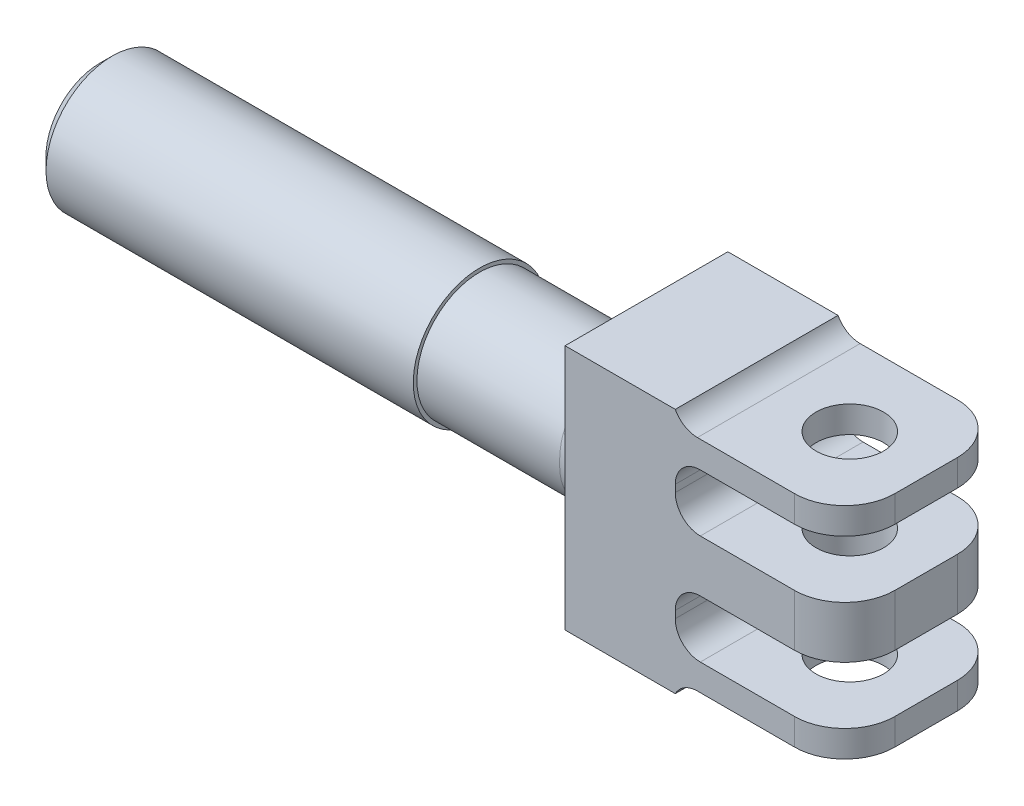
ISO-10303-21;
HEADER;
FILE_DESCRIPTION(('STEP AP214'),'2;1');
FILE_NAME('part.step','',(''),(''),'','','');
FILE_SCHEMA(('AUTOMOTIVE_DESIGN { 1 0 10303 214 1 1 1 1 }'));
ENDSEC;
DATA;
#1=APPLICATION_CONTEXT('core data for automotive mechanical design processes');
#2=APPLICATION_PROTOCOL_DEFINITION('international standard','automotive_design',2000,#1);
#3=PRODUCT_CONTEXT('',#1,'mechanical');
#4=PRODUCT('Part','Part','',(#3));
#5=PRODUCT_RELATED_PRODUCT_CATEGORY('part','',(#4));
#6=PRODUCT_DEFINITION_FORMATION('','',#4);
#7=PRODUCT_DEFINITION_CONTEXT('part definition',#1,'design');
#8=PRODUCT_DEFINITION('design','',#6,#7);
#9=PRODUCT_DEFINITION_SHAPE('','',#8);
#10=(LENGTH_UNIT() NAMED_UNIT(*) SI_UNIT(.MILLI.,.METRE.));
#11=(NAMED_UNIT(*) PLANE_ANGLE_UNIT() SI_UNIT($,.RADIAN.));
#12=(NAMED_UNIT(*) SI_UNIT($,.STERADIAN.) SOLID_ANGLE_UNIT());
#13=UNCERTAINTY_MEASURE_WITH_UNIT(LENGTH_MEASURE(1.E-05),#10,'distance_accuracy_value','');
#14=(GEOMETRIC_REPRESENTATION_CONTEXT(3) GLOBAL_UNCERTAINTY_ASSIGNED_CONTEXT((#13)) GLOBAL_UNIT_ASSIGNED_CONTEXT((#10,
#11,#12)) REPRESENTATION_CONTEXT('',''));
#15=CARTESIAN_POINT('',(0.,0.,0.));
#16=DIRECTION('',(0.,0.,1.));
#17=DIRECTION('',(1.,0.,0.));
#18=AXIS2_PLACEMENT_3D('',#15,#16,#17);
#19=CARTESIAN_POINT('',(0.,14.7499999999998,-9.75));
#20=DIRECTION('',(-1.,0.,0.));
#21=DIRECTION('',(0.,-1.,0.));
#22=AXIS2_PLACEMENT_3D('',#19,#20,#21);
#23=PLANE('',#22);
#24=DIRECTION('',(0.,-1.,0.));
#25=VECTOR('',#24,1.);
#26=CARTESIAN_POINT('',(0.,14.7499999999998,-9.75));
#27=LINE('',#26,#25);
#28=CARTESIAN_POINT('',(0.,14.7499999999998,-9.75));
#29=VERTEX_POINT('',#28);
#30=CARTESIAN_POINT('',(0.,3.89711431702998,-9.75));
#31=VERTEX_POINT('',#30);
#32=EDGE_CURVE('E277',#29,#31,#27,.T.);
#33=ORIENTED_EDGE('',*,*,#32,.T.);
#34=CARTESIAN_POINT('',(0.,0.,0.));
#35=DIRECTION('',(-1.,0.,0.));
#36=DIRECTION('',(0.,-1.,0.));
#37=AXIS2_PLACEMENT_3D('',#34,#35,#36);
#38=CIRCLE('',#37,10.5);
#39=CARTESIAN_POINT('',(0.,3.89711431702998,9.75));
#40=VERTEX_POINT('',#39);
#41=EDGE_CURVE('E15',#31,#40,#38,.F.);
#42=ORIENTED_EDGE('',*,*,#41,.T.);
#43=DIRECTION('',(0.,-1.,0.));
#44=VECTOR('',#43,1.);
#45=CARTESIAN_POINT('',(0.,14.7499999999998,9.75));
#46=LINE('',#45,#44);
#47=CARTESIAN_POINT('',(0.,14.7499999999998,9.75));
#48=VERTEX_POINT('',#47);
#49=EDGE_CURVE('E400',#48,#40,#46,.T.);
#50=ORIENTED_EDGE('',*,*,#49,.F.);
#51=DIRECTION('',(0.,0.,1.));
#52=VECTOR('',#51,1.);
#53=CARTESIAN_POINT('',(0.,14.7499999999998,-9.75));
#54=LINE('',#53,#52);
#55=EDGE_CURVE('E265',#29,#48,#54,.T.);
#56=ORIENTED_EDGE('',*,*,#55,.F.);
#57=EDGE_LOOP('',(#33,#42,#50,#56));
#58=FACE_BOUND('',#57,.T.);
#59=ADVANCED_FACE('F53',(#58),#23,.T.);
#60=CARTESIAN_POINT('',(-185.713203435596,0.,0.));
#61=DIRECTION('',(1.,0.,0.));
#62=DIRECTION('',(0.,1.,0.));
#63=AXIS2_PLACEMENT_3D('',#60,#61,#62);
#64=CYLINDRICAL_SURFACE('',#63,7.5);
#65=CARTESIAN_POINT('',(-3.00000000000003,0.,0.));
#66=DIRECTION('',(-1.,0.,0.));
#67=DIRECTION('',(0.,-1.,0.));
#68=AXIS2_PLACEMENT_3D('',#65,#66,#67);
#69=CIRCLE('',#68,7.5);
#70=CARTESIAN_POINT('',(-3.00000000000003,2.78365308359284,6.96428571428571));
#71=VERTEX_POINT('',#70);
#72=CARTESIAN_POINT('',(-3.00000000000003,2.78365308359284,-6.96428571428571));
#73=VERTEX_POINT('',#72);
#74=EDGE_CURVE('E297',#71,#73,#69,.T.);
#75=ORIENTED_EDGE('',*,*,#74,.T.);
#76=CARTESIAN_POINT('',(-2.97618187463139,3.3807793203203,-6.69479881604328));
#77=CARTESIAN_POINT('',(0.376351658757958,3.20977338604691,-6.78115440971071));
#78=CARTESIAN_POINT('',(0.,4.73309104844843,-9.75));
#79=CARTESIAN_POINT('',(-2.9838141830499,3.29548150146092,-6.73787494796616));
#80=CARTESIAN_POINT('',(0.312853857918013,3.15884841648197,-6.80419612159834));
#81=CARTESIAN_POINT('',(0.,4.61367410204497,-9.75));
#82=CARTESIAN_POINT('',(-2.98932589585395,3.20930517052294,-6.77934473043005));
#83=CARTESIAN_POINT('',(0.252838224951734,3.1021680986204,-6.82968160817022));
#84=CARTESIAN_POINT('',(0.,4.49302723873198,-9.75));
#85=CARTESIAN_POINT('',(-2.99689820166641,3.03538905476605,-6.85897606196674));
#86=CARTESIAN_POINT('',(0.140949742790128,2.97970001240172,-6.88321615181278));
#87=CARTESIAN_POINT('',(0.,4.24954467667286,-9.75));
#88=CARTESIAN_POINT('',(-2.99895979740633,2.94764973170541,-6.89713856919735));
#89=CARTESIAN_POINT('',(0.0888630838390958,2.91399537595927,-6.91125381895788));
#90=CARTESIAN_POINT('',(0.,4.12670962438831,-9.75));
#91=CARTESIAN_POINT('',(-3.00115667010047,2.6824975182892,-7.00647763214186));
#92=CARTESIAN_POINT('',(-0.0546564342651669,2.70703422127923,-6.99589659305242));
#93=CARTESIAN_POINT('',(0.,3.75549652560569,-9.75));
#94=CARTESIAN_POINT('',(-2.99731737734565,2.5029613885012,-7.07260115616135));
#95=CARTESIAN_POINT('',(-0.136830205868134,2.5526905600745,-7.05457718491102));
#96=CARTESIAN_POINT('',(0.,3.50414594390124,-9.75));
#97=CARTESIAN_POINT('',(-2.98434137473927,2.13976709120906,-7.19081611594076));
#98=CARTESIAN_POINT('',(-0.275110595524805,2.22259158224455,-7.16564870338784));
#99=CARTESIAN_POINT('',(0.,2.99567392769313,-9.75));
#100=CARTESIAN_POINT('',(-2.97521241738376,1.95611533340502,-7.2429279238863));
#101=CARTESIAN_POINT('',(-0.332263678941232,2.04649642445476,-7.21850219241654));
#102=CARTESIAN_POINT('',(0.,2.73856146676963,-9.75));
#103=CARTESIAN_POINT('',(-2.95594191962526,1.5853501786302,-7.33301190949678));
#104=CARTESIAN_POINT('',(-0.426021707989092,1.67969651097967,-7.31250960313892));
#105=CARTESIAN_POINT('',(0.,2.21949025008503,-9.75));
#106=CARTESIAN_POINT('',(-2.94580012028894,1.39823590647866,-7.3709804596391));
#107=CARTESIAN_POINT('',(-0.463260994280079,1.48822391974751,-7.35413893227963));
#108=CARTESIAN_POINT('',(0.,1.95753026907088,-9.75));
#109=CARTESIAN_POINT('',(-2.92741443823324,1.01289276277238,-7.43396924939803));
#110=CARTESIAN_POINT('',(-0.522678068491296,1.08743404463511,-7.42398648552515));
#111=CARTESIAN_POINT('',(0.,1.41804986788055,-9.75));
#112=CARTESIAN_POINT('',(-2.91927983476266,0.814549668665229,-7.45831053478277));
#113=CARTESIAN_POINT('',(-0.544510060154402,0.876449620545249,-7.45194201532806));
#114=CARTESIAN_POINT('',(0.,1.14036953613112,-9.75));
#115=CARTESIAN_POINT('',(-2.90802712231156,0.416496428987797,-7.49108829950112));
#116=CARTESIAN_POINT('',(-0.573346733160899,0.450467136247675,-7.48955377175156));
#117=CARTESIAN_POINT('',(0.,0.583095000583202,-9.75));
#118=CARTESIAN_POINT('',(-2.90490848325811,0.216786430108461,-7.4995264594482));
#119=CARTESIAN_POINT('',(-0.580541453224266,0.234145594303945,-7.49945094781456));
#120=CARTESIAN_POINT('',(0.,0.303501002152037,-9.75));
#121=CARTESIAN_POINT('',(-2.90458053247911,-0.182703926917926,-7.50043481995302));
#122=CARTESIAN_POINT('',(-0.581320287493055,-0.197297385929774,-7.50050404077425));
#123=CARTESIAN_POINT('',(0.,-0.255785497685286,-9.75));
#124=CARTESIAN_POINT('',(-2.90737211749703,-0.382484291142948,-7.49290259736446));
#125=CARTESIAN_POINT('',(-0.57490730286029,-0.41379990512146,-7.49166389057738));
#126=CARTESIAN_POINT('',(0.,-0.535478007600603,-9.75));
#127=CARTESIAN_POINT('',(-2.91806560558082,-0.780757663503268,-7.46192498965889));
#128=CARTESIAN_POINT('',(-0.547728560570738,-0.840443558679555,-7.45607780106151));
#129=CARTESIAN_POINT('',(0.,-1.09306072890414,-9.75));
#130=CARTESIAN_POINT('',(-2.92596828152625,-0.979250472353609,-7.43847719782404));
#131=CARTESIAN_POINT('',(-0.526783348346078,-1.0519146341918,-7.42910258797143));
#132=CARTESIAN_POINT('',(0.,-1.37095066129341,-9.75));
#133=CARTESIAN_POINT('',(-2.94479185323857,-1.38002965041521,-7.3748221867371));
#134=CARTESIAN_POINT('',(-0.467005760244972,-1.46987646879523,-7.3582866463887));
#135=CARTESIAN_POINT('',(0.,-1.93204151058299,-9.75));
#136=CARTESIAN_POINT('',(-2.95580186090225,-1.582231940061,-7.33409890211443));
#137=CARTESIAN_POINT('',(-0.427189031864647,-1.67716526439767,-7.31348213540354));
#138=CARTESIAN_POINT('',(0.,-2.21512471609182,-9.75));
#139=CARTESIAN_POINT('',(-2.97656423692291,-1.98257052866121,-7.23615103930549));
#140=CARTESIAN_POINT('',(-0.325006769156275,-2.07268731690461,-7.21143952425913));
#141=CARTESIAN_POINT('',(0.,-2.77559874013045,-9.75));
#142=CARTESIAN_POINT('',(-2.9863169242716,-2.18070784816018,-7.17893065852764));
#143=CARTESIAN_POINT('',(-0.261832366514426,-2.26187984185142,-7.15359961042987));
#144=CARTESIAN_POINT('',(0.,-3.05299098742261,-9.75));
#145=CARTESIAN_POINT('',(-2.99910979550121,-2.57216395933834,-7.04816354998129));
#146=CARTESIAN_POINT('',(-0.106949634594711,-2.61368528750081,-7.03245609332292));
#147=CARTESIAN_POINT('',(0.,-3.60102954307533,-9.75));
#148=CARTESIAN_POINT('',(-3.00213621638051,-2.76547207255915,-6.97458368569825));
#149=CARTESIAN_POINT('',(-0.0138508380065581,-2.77664878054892,-6.96858272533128));
#150=CARTESIAN_POINT('',(0.,-3.87166090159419,-9.75));
#151=CARTESIAN_POINT('',(-2.99645173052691,-3.05038458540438,-6.8524345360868));
#152=CARTESIAN_POINT('',(0.149923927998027,-2.99090115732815,-6.87855871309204));
#153=CARTESIAN_POINT('',(0.,-4.27053841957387,-9.75));
#154=CARTESIAN_POINT('',(-2.99284677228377,-3.14457795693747,-6.80972090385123));
#155=CARTESIAN_POINT('',(0.209673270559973,-3.05819455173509,-6.84906880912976));
#156=CARTESIAN_POINT('',(0.,-4.40240913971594,-9.75));
#157=CARTESIAN_POINT('',(-2.98117625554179,-3.33104095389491,-6.7204808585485));
#158=CARTESIAN_POINT('',(0.338338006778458,-3.18159750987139,-6.79404093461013));
#159=CARTESIAN_POINT('',(0.,-4.66345733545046,-9.75));
#160=CARTESIAN_POINT('',(-2.97310884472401,-3.42330976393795,-6.67395286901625));
#161=CARTESIAN_POINT('',(0.407539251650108,-3.23756692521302,-6.76854398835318));
#162=CARTESIAN_POINT('',(0.,-4.79263366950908,-9.75));
#163=CARTESIAN_POINT('',(-2.96228911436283,-3.51448137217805,-6.62558832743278));
#164=CARTESIAN_POINT('',(0.480755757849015,-3.28633251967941,-6.74660775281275));
#165=CARTESIAN_POINT('',(0.,-4.92027392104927,-9.75));
#166=(BOUNDED_SURFACE() B_SPLINE_SURFACE(3,2,((#76,#77,#78),(#79,#80,#81),(#82,#83,#84),(#85,
#86,#87),(#88,#89,#90),(#91,#92,#93),(#94,#95,#96),(#97,#98,#99),(#100,#101,#102),(#103,#104,
#105),(#106,#107,#108),(#109,#110,#111),(#112,#113,#114),(#115,#116,#117),(#118,#119,#120),
(#121,#122,#123),(#124,#125,#126),(#127,#128,#129),(#130,#131,#132),(#133,#134,#135),(#136,#137,
#138),(#139,#140,#141),(#142,#143,#144),(#145,#146,#147),(#148,#149,#150),(#151,#152,#153),
(#154,#155,#156),(#157,#158,#159),(#160,#161,#162),(#163,#164,#165)),.UNSPECIFIED.,.F.,.F.,
.F.) B_SPLINE_SURFACE_WITH_KNOTS((4,2,2,2,2,2,2,2,2,2,2,2,2,2,4),(3,3),(0.,0.401893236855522,
0.80366964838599,1.60633551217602,2.40782795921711,3.20952583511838,4.04824757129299,
4.88688066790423,5.72564101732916,6.56452823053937,7.43046741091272,8.29618646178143,
9.16367528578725,9.59802803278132,10.0325612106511),(0.,1.),
.UNSPECIFIED.) GEOMETRIC_REPRESENTATION_ITEM() RATIONAL_B_SPLINE_SURFACE(((1.,0.666236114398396,
1.),(1.,0.67269891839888,1.),(1.,0.67895565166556,1.),(1.,0.69102452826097,1.),(1.,
0.696836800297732,1.),(1.,0.713551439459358,1.),(1.,0.723746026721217,1.),(1.,0.742060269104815,
1.),(1.,0.750182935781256,1.),(1.,0.764268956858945,1.),(1.,0.770231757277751,1.),(1.,
0.780141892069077,1.),(1.,0.783983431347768,1.),(1.,0.789159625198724,1.),(1.,0.790494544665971,
1.),(1.,0.790638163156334,1.),(1.,0.789446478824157,1.),(1.,0.784553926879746,1.),(1.,
0.780852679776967,1.),(1.,0.770834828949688,1.),(1.,0.764437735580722,1.),(1.,0.749124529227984,
1.),(1.,0.740209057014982,1.),(1.,0.719973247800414,1.),(1.,0.708648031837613,1.),(1.,
0.690030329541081,1.),(1.,0.683547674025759,1.),(1.,0.670080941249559,1.),(1.,0.663096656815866,
1.),(1.,0.655884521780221,1.))) REPRESENTATION_ITEM('') SURFACE());
#167=CARTESIAN_POINT('',(-2.97618187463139,3.3807793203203,-6.69479881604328));
#168=CARTESIAN_POINT('',(-2.98381418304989,3.29548150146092,-6.73787494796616));
#169=CARTESIAN_POINT('',(-2.98932589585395,3.20930517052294,-6.77934473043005));
#170=CARTESIAN_POINT('',(-2.99689820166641,3.03538905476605,-6.85897606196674));
#171=CARTESIAN_POINT('',(-2.99895979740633,2.94764973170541,-6.89713856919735));
#172=CARTESIAN_POINT('',(-3.00115667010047,2.6824975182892,-7.00647763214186));
#173=CARTESIAN_POINT('',(-2.99731737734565,2.5029613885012,-7.07260115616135));
#174=CARTESIAN_POINT('',(-2.98434137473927,2.13976709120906,-7.19081611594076));
#175=CARTESIAN_POINT('',(-2.97521241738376,1.95611533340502,-7.2429279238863));
#176=CARTESIAN_POINT('',(-2.95594191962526,1.5853501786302,-7.33301190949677));
#177=CARTESIAN_POINT('',(-2.94580012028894,1.39823590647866,-7.37098045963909));
#178=CARTESIAN_POINT('',(-2.92741443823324,1.01289276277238,-7.43396924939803));
#179=CARTESIAN_POINT('',(-2.91927983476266,0.814549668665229,-7.45831053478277));
#180=CARTESIAN_POINT('',(-2.90802712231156,0.416496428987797,-7.49108829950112));
#181=CARTESIAN_POINT('',(-2.90490848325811,0.216786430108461,-7.4995264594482));
#182=CARTESIAN_POINT('',(-2.90458053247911,-0.182703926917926,-7.50043481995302));
#183=CARTESIAN_POINT('',(-2.90737211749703,-0.382484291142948,-7.49290259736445));
#184=CARTESIAN_POINT('',(-2.91806560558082,-0.780757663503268,-7.46192498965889));
#185=CARTESIAN_POINT('',(-2.92596828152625,-0.979250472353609,-7.43847719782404));
#186=CARTESIAN_POINT('',(-2.94479185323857,-1.38002965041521,-7.3748221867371));
#187=CARTESIAN_POINT('',(-2.95580186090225,-1.582231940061,-7.33409890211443));
#188=CARTESIAN_POINT('',(-2.97656423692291,-1.98257052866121,-7.23615103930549));
#189=CARTESIAN_POINT('',(-2.9863169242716,-2.18070784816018,-7.17893065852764));
#190=CARTESIAN_POINT('',(-2.99910979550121,-2.57216395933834,-7.04816354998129));
#191=CARTESIAN_POINT('',(-3.00213621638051,-2.76547207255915,-6.97458368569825));
#192=CARTESIAN_POINT('',(-2.99645173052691,-3.05038458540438,-6.8524345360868));
#193=CARTESIAN_POINT('',(-2.99284677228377,-3.14457795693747,-6.80972090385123));
#194=CARTESIAN_POINT('',(-2.98117625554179,-3.33104095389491,-6.7204808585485));
#195=CARTESIAN_POINT('',(-2.97310884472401,-3.42330976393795,-6.67395286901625));
#196=CARTESIAN_POINT('',(-2.96228911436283,-3.51448137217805,-6.62558832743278));
#197=B_SPLINE_CURVE_WITH_KNOTS('',3,(#167,#168,#169,#170,#171,#172,#173,#174,#175,#176,#177,
#178,#179,#180,#181,#182,#183,#184,#185,#186,#187,#188,#189,#190,#191,#192,#193,#194,#195,#196),
.UNSPECIFIED.,.F.,.F.,(4,2,2,2,2,2,2,2,2,2,2,2,2,2,4),(0.,0.401893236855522,0.80366964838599,
1.60633551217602,2.40782795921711,3.20952583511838,4.04824757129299,4.88688066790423,
5.72564101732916,6.56452823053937,7.43046741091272,8.29618646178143,9.16367528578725,
9.59802803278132,10.0325612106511),.UNSPECIFIED.);
#198=CARTESIAN_POINT('',(-3.00000000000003,-2.78365308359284,-6.96428571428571));
#199=VERTEX_POINT('',#198);
#200=EDGE_CURVE('E411',#73,#199,#197,.T.);
#201=ORIENTED_EDGE('',*,*,#200,.T.);
#202=CARTESIAN_POINT('',(-3.00000000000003,0.,0.));
#203=DIRECTION('',(-1.,0.,0.));
#204=DIRECTION('',(0.,-1.,0.));
#205=AXIS2_PLACEMENT_3D('',#202,#203,#204);
#206=CIRCLE('',#205,7.5);
#207=CARTESIAN_POINT('',(-3.00000000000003,-2.78365308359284,6.96428571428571));
#208=VERTEX_POINT('',#207);
#209=EDGE_CURVE('E312',#199,#208,#206,.T.);
#210=ORIENTED_EDGE('',*,*,#209,.T.);
#211=CARTESIAN_POINT('',(-2.97618187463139,-3.3807793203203,6.69479881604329));
#212=CARTESIAN_POINT('',(0.376351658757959,-3.20977338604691,6.78115440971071));
#213=CARTESIAN_POINT('',(0.,-4.73309104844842,9.75));
#214=CARTESIAN_POINT('',(-2.98381418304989,-3.29548150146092,6.73787494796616));
#215=CARTESIAN_POINT('',(0.312853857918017,-3.15884841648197,6.80419612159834));
#216=CARTESIAN_POINT('',(0.,-4.61367410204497,9.75));
#217=CARTESIAN_POINT('',(-2.98932589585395,-3.20930517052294,6.77934473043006));
#218=CARTESIAN_POINT('',(0.252838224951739,-3.1021680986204,6.82968160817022));
#219=CARTESIAN_POINT('',(0.,-4.49302723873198,9.75));
#220=CARTESIAN_POINT('',(-2.99689820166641,-3.03538905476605,6.85897606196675));
#221=CARTESIAN_POINT('',(0.140949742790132,-2.97970001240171,6.88321615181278));
#222=CARTESIAN_POINT('',(0.,-4.24954467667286,9.75));
#223=CARTESIAN_POINT('',(-2.99895979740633,-2.94764973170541,6.89713856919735));
#224=CARTESIAN_POINT('',(0.0888630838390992,-2.91399537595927,6.91125381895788));
#225=CARTESIAN_POINT('',(0.,-4.12670962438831,9.75));
#226=CARTESIAN_POINT('',(-3.00115667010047,-2.6824975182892,7.00647763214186));
#227=CARTESIAN_POINT('',(-0.0546564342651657,-2.70703422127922,6.99589659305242));
#228=CARTESIAN_POINT('',(0.,-3.75549652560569,9.75));
#229=CARTESIAN_POINT('',(-2.99731737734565,-2.5029613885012,7.07260115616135));
#230=CARTESIAN_POINT('',(-0.136830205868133,-2.55269056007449,7.05457718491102));
#231=CARTESIAN_POINT('',(0.,-3.50414594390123,9.75));
#232=CARTESIAN_POINT('',(-2.98434137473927,-2.13976709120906,7.19081611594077));
#233=CARTESIAN_POINT('',(-0.275110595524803,-2.22259158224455,7.16564870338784));
#234=CARTESIAN_POINT('',(0.,-2.99567392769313,9.75));
#235=CARTESIAN_POINT('',(-2.97521241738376,-1.95611533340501,7.24292792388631));
#236=CARTESIAN_POINT('',(-0.332263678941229,-2.04649642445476,7.21850219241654));
#237=CARTESIAN_POINT('',(0.,-2.73856146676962,9.75));
#238=CARTESIAN_POINT('',(-2.95594191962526,-1.58535017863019,7.33301190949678));
#239=CARTESIAN_POINT('',(-0.42602170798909,-1.67969651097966,7.31250960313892));
#240=CARTESIAN_POINT('',(0.,-2.21949025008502,9.75));
#241=CARTESIAN_POINT('',(-2.94580012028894,-1.39823590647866,7.3709804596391));
#242=CARTESIAN_POINT('',(-0.463260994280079,-1.48822391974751,7.35413893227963));
#243=CARTESIAN_POINT('',(0.,-1.95753026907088,9.75));
#244=CARTESIAN_POINT('',(-2.92741443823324,-1.01289276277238,7.43396924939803));
#245=CARTESIAN_POINT('',(-0.522678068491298,-1.08743404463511,7.42398648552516));
#246=CARTESIAN_POINT('',(0.,-1.41804986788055,9.75));
#247=CARTESIAN_POINT('',(-2.91927983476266,-0.814549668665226,7.45831053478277));
#248=CARTESIAN_POINT('',(-0.544510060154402,-0.876449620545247,7.45194201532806));
#249=CARTESIAN_POINT('',(0.,-1.14036953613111,9.75));
#250=CARTESIAN_POINT('',(-2.90802712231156,-0.416496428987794,7.49108829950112));
#251=CARTESIAN_POINT('',(-0.573346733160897,-0.450467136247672,7.48955377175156));
#252=CARTESIAN_POINT('',(0.,-0.583095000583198,9.75));
#253=CARTESIAN_POINT('',(-2.90490848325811,-0.216786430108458,7.4995264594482));
#254=CARTESIAN_POINT('',(-0.580541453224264,-0.234145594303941,7.49945094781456));
#255=CARTESIAN_POINT('',(0.,-0.303501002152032,9.75));
#256=CARTESIAN_POINT('',(-2.90458053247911,0.182703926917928,7.50043481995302));
#257=CARTESIAN_POINT('',(-0.581320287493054,0.197297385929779,7.50050404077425));
#258=CARTESIAN_POINT('',(0.,0.255785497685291,9.75));
#259=CARTESIAN_POINT('',(-2.90737211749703,0.382484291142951,7.49290259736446));
#260=CARTESIAN_POINT('',(-0.574907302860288,0.413799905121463,7.49166389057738));
#261=CARTESIAN_POINT('',(0.,0.535478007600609,9.75));
#262=CARTESIAN_POINT('',(-2.91806560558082,0.780757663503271,7.46192498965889));
#263=CARTESIAN_POINT('',(-0.547728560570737,0.840443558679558,7.45607780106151));
#264=CARTESIAN_POINT('',(0.,1.09306072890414,9.75));
#265=CARTESIAN_POINT('',(-2.92596828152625,0.979250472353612,7.43847719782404));
#266=CARTESIAN_POINT('',(-0.526783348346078,1.0519146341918,7.42910258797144));
#267=CARTESIAN_POINT('',(0.,1.37095066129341,9.75));
#268=CARTESIAN_POINT('',(-2.94479185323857,1.38002965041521,7.3748221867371));
#269=CARTESIAN_POINT('',(-0.467005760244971,1.46987646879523,7.3582866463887));
#270=CARTESIAN_POINT('',(0.,1.93204151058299,9.75));
#271=CARTESIAN_POINT('',(-2.95580186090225,1.582231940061,7.33409890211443));
#272=CARTESIAN_POINT('',(-0.427189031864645,1.67716526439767,7.31348213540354));
#273=CARTESIAN_POINT('',(0.,2.21512471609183,9.75));
#274=CARTESIAN_POINT('',(-2.97656423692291,1.98257052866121,7.23615103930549));
#275=CARTESIAN_POINT('',(-0.325006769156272,2.07268731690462,7.21143952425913));
#276=CARTESIAN_POINT('',(0.,2.77559874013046,9.75));
#277=CARTESIAN_POINT('',(-2.9863169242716,2.18070784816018,7.17893065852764));
#278=CARTESIAN_POINT('',(-0.261832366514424,2.26187984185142,7.15359961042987));
#279=CARTESIAN_POINT('',(0.,3.05299098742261,9.75));
#280=CARTESIAN_POINT('',(-2.99910979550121,2.57216395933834,7.04816354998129));
#281=CARTESIAN_POINT('',(-0.106949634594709,2.61368528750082,7.03245609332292));
#282=CARTESIAN_POINT('',(0.,3.60102954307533,9.75));
#283=CARTESIAN_POINT('',(-3.00213621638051,2.76547207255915,6.97458368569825));
#284=CARTESIAN_POINT('',(-0.0138508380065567,2.77664878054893,6.96858272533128));
#285=CARTESIAN_POINT('',(0.,3.8716609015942,9.75));
#286=CARTESIAN_POINT('',(-2.99645173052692,3.05038458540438,6.8524345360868));
#287=CARTESIAN_POINT('',(0.149923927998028,2.99090115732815,6.87855871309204));
#288=CARTESIAN_POINT('',(0.,4.27053841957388,9.75));
#289=CARTESIAN_POINT('',(-2.99284677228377,3.14457795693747,6.80972090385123));
#290=CARTESIAN_POINT('',(0.209673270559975,3.05819455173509,6.84906880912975));
#291=CARTESIAN_POINT('',(0.,4.40240913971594,9.75));
#292=CARTESIAN_POINT('',(-2.98117625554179,3.33104095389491,6.7204808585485));
#293=CARTESIAN_POINT('',(0.33833800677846,3.18159750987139,6.79404093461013));
#294=CARTESIAN_POINT('',(0.,4.66345733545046,9.75));
#295=CARTESIAN_POINT('',(-2.97310884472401,3.42330976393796,6.67395286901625));
#296=CARTESIAN_POINT('',(0.407539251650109,3.23756692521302,6.76854398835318));
#297=CARTESIAN_POINT('',(0.,4.79263366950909,9.75));
#298=CARTESIAN_POINT('',(-2.96228911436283,3.51448137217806,6.62558832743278));
#299=CARTESIAN_POINT('',(0.480755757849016,3.28633251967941,6.74660775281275));
#300=CARTESIAN_POINT('',(0.,4.92027392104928,9.75));
#301=(BOUNDED_SURFACE() B_SPLINE_SURFACE(3,2,((#211,#212,#213),(#214,#215,#216),(#217,#218,
#219),(#220,#221,#222),(#223,#224,#225),(#226,#227,#228),(#229,#230,#231),(#232,#233,#234),
(#235,#236,#237),(#238,#239,#240),(#241,#242,#243),(#244,#245,#246),(#247,#248,#249),(#250,#251,
#252),(#253,#254,#255),(#256,#257,#258),(#259,#260,#261),(#262,#263,#264),(#265,#266,#267),
(#268,#269,#270),(#271,#272,#273),(#274,#275,#276),(#277,#278,#279),(#280,#281,#282),(#283,#284,
#285),(#286,#287,#288),(#289,#290,#291),(#292,#293,#294),(#295,#296,#297),(#298,#299,#300)),
.UNSPECIFIED.,.F.,.F.,.F.) B_SPLINE_SURFACE_WITH_KNOTS((4,2,2,2,2,2,2,2,2,2,2,2,2,2,4),(3,3),
(0.,0.401893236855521,0.803669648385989,1.60633551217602,2.40782795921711,3.20952583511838,
4.04824757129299,4.88688066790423,5.72564101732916,6.56452823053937,7.43046741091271,
8.29618646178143,9.16367528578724,9.59802803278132,10.0325612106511),(0.,1.),
.UNSPECIFIED.) GEOMETRIC_REPRESENTATION_ITEM() RATIONAL_B_SPLINE_SURFACE(((1.,0.666236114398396,
1.),(1.,0.67269891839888,1.),(1.,0.67895565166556,1.),(1.,0.69102452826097,1.),(1.,
0.696836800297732,1.),(1.,0.713551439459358,1.),(1.,0.723746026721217,1.),(1.,0.742060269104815,
1.),(1.,0.750182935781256,1.),(1.,0.764268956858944,1.),(1.,0.770231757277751,1.),(1.,
0.780141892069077,1.),(1.,0.783983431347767,1.),(1.,0.789159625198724,1.),(1.,0.790494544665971,
1.),(1.,0.790638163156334,1.),(1.,0.789446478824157,1.),(1.,0.784553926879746,1.),(1.,
0.780852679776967,1.),(1.,0.770834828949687,1.),(1.,0.764437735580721,1.),(1.,0.749124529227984,
1.),(1.,0.740209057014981,1.),(1.,0.719973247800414,1.),(1.,0.708648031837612,1.),(1.,
0.690030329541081,1.),(1.,0.683547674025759,1.),(1.,0.670080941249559,1.),(1.,0.663096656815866,
1.),(1.,0.655884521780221,1.))) REPRESENTATION_ITEM('') SURFACE());
#302=CARTESIAN_POINT('',(-2.97618187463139,-3.3807793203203,6.69479881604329));
#303=CARTESIAN_POINT('',(-2.98381418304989,-3.29548150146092,6.73787494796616));
#304=CARTESIAN_POINT('',(-2.98932589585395,-3.20930517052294,6.77934473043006));
#305=CARTESIAN_POINT('',(-2.99689820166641,-3.03538905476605,6.85897606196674));
#306=CARTESIAN_POINT('',(-2.99895979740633,-2.94764973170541,6.89713856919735));
#307=CARTESIAN_POINT('',(-3.00115667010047,-2.6824975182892,7.00647763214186));
#308=CARTESIAN_POINT('',(-2.99731737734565,-2.5029613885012,7.07260115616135));
#309=CARTESIAN_POINT('',(-2.98434137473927,-2.13976709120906,7.19081611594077));
#310=CARTESIAN_POINT('',(-2.97521241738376,-1.95611533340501,7.24292792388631));
#311=CARTESIAN_POINT('',(-2.95594191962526,-1.58535017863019,7.33301190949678));
#312=CARTESIAN_POINT('',(-2.94580012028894,-1.39823590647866,7.3709804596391));
#313=CARTESIAN_POINT('',(-2.92741443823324,-1.01289276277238,7.43396924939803));
#314=CARTESIAN_POINT('',(-2.91927983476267,-0.814549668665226,7.45831053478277));
#315=CARTESIAN_POINT('',(-2.90802712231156,-0.416496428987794,7.49108829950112));
#316=CARTESIAN_POINT('',(-2.90490848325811,-0.216786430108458,7.4995264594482));
#317=CARTESIAN_POINT('',(-2.90458053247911,0.182703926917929,7.50043481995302));
#318=CARTESIAN_POINT('',(-2.90737211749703,0.38248429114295,7.49290259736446));
#319=CARTESIAN_POINT('',(-2.91806560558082,0.780757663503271,7.46192498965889));
#320=CARTESIAN_POINT('',(-2.92596828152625,0.979250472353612,7.43847719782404));
#321=CARTESIAN_POINT('',(-2.94479185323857,1.38002965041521,7.3748221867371));
#322=CARTESIAN_POINT('',(-2.95580186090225,1.582231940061,7.33409890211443));
#323=CARTESIAN_POINT('',(-2.97656423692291,1.98257052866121,7.23615103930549));
#324=CARTESIAN_POINT('',(-2.9863169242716,2.18070784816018,7.17893065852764));
#325=CARTESIAN_POINT('',(-2.99910979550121,2.57216395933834,7.04816354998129));
#326=CARTESIAN_POINT('',(-3.00213621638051,2.76547207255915,6.97458368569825));
#327=CARTESIAN_POINT('',(-2.99645173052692,3.05038458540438,6.8524345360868));
#328=CARTESIAN_POINT('',(-2.99284677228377,3.14457795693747,6.80972090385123));
#329=CARTESIAN_POINT('',(-2.98117625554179,3.33104095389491,6.7204808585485));
#330=CARTESIAN_POINT('',(-2.97310884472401,3.42330976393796,6.67395286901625));
#331=CARTESIAN_POINT('',(-2.96228911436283,3.51448137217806,6.62558832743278));
#332=B_SPLINE_CURVE_WITH_KNOTS('',3,(#302,#303,#304,#305,#306,#307,#308,#309,#310,#311,#312,
#313,#314,#315,#316,#317,#318,#319,#320,#321,#322,#323,#324,#325,#326,#327,#328,#329,#330,#331),
.UNSPECIFIED.,.F.,.F.,(4,2,2,2,2,2,2,2,2,2,2,2,2,2,4),(0.,0.401893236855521,0.803669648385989,
1.60633551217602,2.40782795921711,3.20952583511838,4.04824757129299,4.88688066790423,
5.72564101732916,6.56452823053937,7.43046741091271,8.29618646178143,9.16367528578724,
9.59802803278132,10.0325612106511),.UNSPECIFIED.);
#333=EDGE_CURVE('E304',#208,#71,#332,.T.);
#334=ORIENTED_EDGE('',*,*,#333,.T.);
#335=EDGE_LOOP('',(#75,#201,#210,#334));
#336=FACE_BOUND('',#335,.T.);
#337=CARTESIAN_POINT('',(-20.,0.,0.));
#338=DIRECTION('',(-1.,0.,0.));
#339=DIRECTION('',(0.,-1.,0.));
#340=AXIS2_PLACEMENT_3D('',#337,#338,#339);
#341=CIRCLE('',#340,7.5);
#342=CARTESIAN_POINT('',(-20.,-7.5,0.));
#343=VERTEX_POINT('',#342);
#344=EDGE_CURVE('E518',#343,#343,#341,.T.);
#345=ORIENTED_EDGE('',*,*,#344,.F.);
#346=EDGE_LOOP('',(#345));
#347=FACE_BOUND('',#346,.T.);
#348=ADVANCED_FACE('F314',(#336,#347),#64,.T.);
#349=CARTESIAN_POINT('',(0.,-3.89711431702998,9.75));
#350=VERTEX_POINT('',#349);
#351=CARTESIAN_POINT('',(0.,-14.7499999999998,9.75));
#352=VERTEX_POINT('',#351);
#353=EDGE_CURVE('E391',#350,#352,#46,.T.);
#354=ORIENTED_EDGE('',*,*,#353,.F.);
#355=CARTESIAN_POINT('',(0.,0.,0.));
#356=DIRECTION('',(-1.,0.,0.));
#357=DIRECTION('',(0.,-1.,0.));
#358=AXIS2_PLACEMENT_3D('',#355,#356,#357);
#359=CIRCLE('',#358,10.5);
#360=CARTESIAN_POINT('',(0.,-3.89711431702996,-9.75));
#361=VERTEX_POINT('',#360);
#362=EDGE_CURVE('E66',#350,#361,#359,.F.);
#363=ORIENTED_EDGE('',*,*,#362,.T.);
#364=CARTESIAN_POINT('',(0.,-14.7499999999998,-9.75));
#365=VERTEX_POINT('',#364);
#366=EDGE_CURVE('E278',#361,#365,#27,.T.);
#367=ORIENTED_EDGE('',*,*,#366,.T.);
#368=DIRECTION('',(0.,0.,1.));
#369=VECTOR('',#368,1.);
#370=CARTESIAN_POINT('',(0.,-14.7499999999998,-9.75));
#371=LINE('',#370,#369);
#372=EDGE_CURVE('E394',#365,#352,#371,.T.);
#373=ORIENTED_EDGE('',*,*,#372,.T.);
#374=EDGE_LOOP('',(#354,#363,#367,#373));
#375=FACE_BOUND('',#374,.T.);
#376=ADVANCED_FACE('F339',(#375),#23,.T.);
#377=CARTESIAN_POINT('',(33.5,3.11,-9.75));
#378=DIRECTION('',(0.,1.,0.));
#379=DIRECTION('',(-1.,0.,0.));
#380=AXIS2_PLACEMENT_3D('',#377,#378,#379);
#381=PLANE('',#380);
#382=CARTESIAN_POINT('',(24.36,3.11,0.));
#383=DIRECTION('',(0.,1.,0.));
#384=DIRECTION('',(-1.,0.,0.));
#385=AXIS2_PLACEMENT_3D('',#382,#383,#384);
#386=CIRCLE('',#385,4.04999999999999);
#387=CARTESIAN_POINT('',(20.31,3.11,0.));
#388=VERTEX_POINT('',#387);
#389=EDGE_CURVE('E298',#388,#388,#386,.T.);
#390=ORIENTED_EDGE('',*,*,#389,.F.);
#391=EDGE_LOOP('',(#390));
#392=FACE_BOUND('',#391,.T.);
#393=DIRECTION('',(-1.,0.,0.));
#394=VECTOR('',#393,1.);
#395=CARTESIAN_POINT('',(33.5,3.11,-9.75));
#396=LINE('',#395,#394);
#397=CARTESIAN_POINT('',(27.5,3.11,-9.75));
#398=VERTEX_POINT('',#397);
#399=CARTESIAN_POINT('',(16.2,3.11,-9.75));
#400=VERTEX_POINT('',#399);
#401=EDGE_CURVE('E477',#398,#400,#396,.T.);
#402=ORIENTED_EDGE('',*,*,#401,.T.);
#403=DIRECTION('',(0.,0.,1.));
#404=VECTOR('',#403,1.);
#405=CARTESIAN_POINT('',(16.2,3.11,9.75));
#406=LINE('',#405,#404);
#407=CARTESIAN_POINT('',(16.2,3.11,9.75));
#408=VERTEX_POINT('',#407);
#409=EDGE_CURVE('E480',#400,#408,#406,.T.);
#410=ORIENTED_EDGE('',*,*,#409,.T.);
#411=DIRECTION('',(-1.,0.,0.));
#412=VECTOR('',#411,1.);
#413=CARTESIAN_POINT('',(33.5,3.11,9.75));
#414=LINE('',#413,#412);
#415=CARTESIAN_POINT('',(27.5,3.11,9.75));
#416=VERTEX_POINT('',#415);
#417=EDGE_CURVE('E638',#416,#408,#414,.T.);
#418=ORIENTED_EDGE('',*,*,#417,.F.);
#419=CARTESIAN_POINT('',(27.5,3.11,3.75));
#420=DIRECTION('',(0.,1.,0.));
#421=DIRECTION('',(-1.,0.,0.));
#422=AXIS2_PLACEMENT_3D('',#419,#420,#421);
#423=CIRCLE('',#422,6.);
#424=CARTESIAN_POINT('',(33.5,3.11,3.75));
#425=VERTEX_POINT('',#424);
#426=EDGE_CURVE('E585',#416,#425,#423,.T.);
#427=ORIENTED_EDGE('',*,*,#426,.T.);
#428=DIRECTION('',(0.,0.,1.));
#429=VECTOR('',#428,1.);
#430=CARTESIAN_POINT('',(33.5,3.11,-9.75));
#431=LINE('',#430,#429);
#432=CARTESIAN_POINT('',(33.5,3.11,-3.75));
#433=VERTEX_POINT('',#432);
#434=EDGE_CURVE('E515',#433,#425,#431,.T.);
#435=ORIENTED_EDGE('',*,*,#434,.F.);
#436=CARTESIAN_POINT('',(27.5,3.11,-3.75));
#437=DIRECTION('',(0.,1.,0.));
#438=DIRECTION('',(-1.,0.,0.));
#439=AXIS2_PLACEMENT_3D('',#436,#437,#438);
#440=CIRCLE('',#439,6.);
#441=EDGE_CURVE('E587',#433,#398,#440,.T.);
#442=ORIENTED_EDGE('',*,*,#441,.T.);
#443=EDGE_LOOP('',(#402,#410,#418,#427,#435,#442));
#444=FACE_BOUND('',#443,.T.);
#445=ADVANCED_FACE('F383',(#392,#444),#381,.T.);
#446=CARTESIAN_POINT('',(33.5,-3.11,-9.75));
#447=DIRECTION('',(1.,0.,0.));
#448=DIRECTION('',(0.,0.,-1.));
#449=AXIS2_PLACEMENT_3D('',#446,#447,#448);
#450=PLANE('',#449);
#451=DIRECTION('',(0.,0.,1.));
#452=VECTOR('',#451,1.);
#453=CARTESIAN_POINT('',(33.5,-3.11,-9.75));
#454=LINE('',#453,#452);
#455=CARTESIAN_POINT('',(33.5,-3.11,-3.75));
#456=VERTEX_POINT('',#455);
#457=CARTESIAN_POINT('',(33.5,-3.11,3.75));
#458=VERTEX_POINT('',#457);
#459=EDGE_CURVE('E519',#456,#458,#454,.T.);
#460=ORIENTED_EDGE('',*,*,#459,.F.);
#461=DIRECTION('',(0.,1.,0.));
#462=VECTOR('',#461,1.);
#463=CARTESIAN_POINT('',(33.5,-3.11,-3.75));
#464=LINE('',#463,#462);
#465=EDGE_CURVE('E582',#456,#433,#464,.T.);
#466=ORIENTED_EDGE('',*,*,#465,.T.);
#467=ORIENTED_EDGE('',*,*,#434,.T.);
#468=DIRECTION('',(0.,1.,0.));
#469=VECTOR('',#468,1.);
#470=CARTESIAN_POINT('',(33.5,-3.11,3.75));
#471=LINE('',#470,#469);
#472=EDGE_CURVE('E580',#425,#458,#471,.F.);
#473=ORIENTED_EDGE('',*,*,#472,.T.);
#474=EDGE_LOOP('',(#460,#466,#467,#473));
#475=FACE_BOUND('',#474,.T.);
#476=ADVANCED_FACE('F387',(#475),#450,.T.);
#477=CARTESIAN_POINT('',(13.2,-3.11,-9.75));
#478=DIRECTION('',(0.,-1.,0.));
#479=DIRECTION('',(1.,0.,0.));
#480=AXIS2_PLACEMENT_3D('',#477,#478,#479);
#481=PLANE('',#480);
#482=CARTESIAN_POINT('',(24.36,-3.11,0.));
#483=DIRECTION('',(0.,-1.,0.));
#484=DIRECTION('',(1.,0.,0.));
#485=AXIS2_PLACEMENT_3D('',#482,#483,#484);
#486=CIRCLE('',#485,4.04999999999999);
#487=CARTESIAN_POINT('',(28.41,-3.11,0.));
#488=VERTEX_POINT('',#487);
#489=EDGE_CURVE('E730',#488,#488,#486,.T.);
#490=ORIENTED_EDGE('',*,*,#489,.F.);
#491=EDGE_LOOP('',(#490));
#492=FACE_BOUND('',#491,.T.);
#493=DIRECTION('',(1.,0.,0.));
#494=VECTOR('',#493,1.);
#495=CARTESIAN_POINT('',(13.2,-3.11,9.75));
#496=LINE('',#495,#494);
#497=CARTESIAN_POINT('',(16.2,-3.11,9.75));
#498=VERTEX_POINT('',#497);
#499=CARTESIAN_POINT('',(27.5,-3.11,9.75));
#500=VERTEX_POINT('',#499);
#501=EDGE_CURVE('E513',#498,#500,#496,.T.);
#502=ORIENTED_EDGE('',*,*,#501,.F.);
#503=DIRECTION('',(0.,0.,1.));
#504=VECTOR('',#503,1.);
#505=CARTESIAN_POINT('',(16.2,-3.11,-9.75));
#506=LINE('',#505,#504);
#507=CARTESIAN_POINT('',(16.2,-3.11,-9.75));
#508=VERTEX_POINT('',#507);
#509=EDGE_CURVE('E485',#498,#508,#506,.F.);
#510=ORIENTED_EDGE('',*,*,#509,.T.);
#511=DIRECTION('',(1.,0.,0.));
#512=VECTOR('',#511,1.);
#513=CARTESIAN_POINT('',(13.2,-3.11,-9.75));
#514=LINE('',#513,#512);
#515=CARTESIAN_POINT('',(27.5,-3.11,-9.75));
#516=VERTEX_POINT('',#515);
#517=EDGE_CURVE('E535',#508,#516,#514,.T.);
#518=ORIENTED_EDGE('',*,*,#517,.T.);
#519=CARTESIAN_POINT('',(27.5,-3.11,-3.75));
#520=DIRECTION('',(0.,-1.,0.));
#521=DIRECTION('',(1.,0.,0.));
#522=AXIS2_PLACEMENT_3D('',#519,#520,#521);
#523=CIRCLE('',#522,6.);
#524=EDGE_CURVE('E592',#516,#456,#523,.T.);
#525=ORIENTED_EDGE('',*,*,#524,.T.);
#526=ORIENTED_EDGE('',*,*,#459,.T.);
#527=CARTESIAN_POINT('',(27.5,-3.11,3.75));
#528=DIRECTION('',(0.,-1.,0.));
#529=DIRECTION('',(1.,0.,0.));
#530=AXIS2_PLACEMENT_3D('',#527,#528,#529);
#531=CIRCLE('',#530,6.);
#532=EDGE_CURVE('E589',#458,#500,#531,.T.);
#533=ORIENTED_EDGE('',*,*,#532,.T.);
#534=EDGE_LOOP('',(#502,#510,#518,#525,#526,#533));
#535=FACE_BOUND('',#534,.T.);
#536=ADVANCED_FACE('F607',(#492,#535),#481,.T.);
#537=CARTESIAN_POINT('',(13.2,-9.97000000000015,-9.75));
#538=DIRECTION('',(1.,0.,0.));
#539=DIRECTION('',(0.,1.,0.));
#540=AXIS2_PLACEMENT_3D('',#537,#538,#539);
#541=PLANE('',#540);
#542=DIRECTION('',(0.,1.,0.));
#543=VECTOR('',#542,1.);
#544=CARTESIAN_POINT('',(13.2,-9.97000000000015,9.75));
#545=LINE('',#544,#543);
#546=CARTESIAN_POINT('',(13.2,-6.97000000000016,9.75));
#547=VERTEX_POINT('',#546);
#548=CARTESIAN_POINT('',(13.2,-6.11,9.75));
#549=VERTEX_POINT('',#548);
#550=EDGE_CURVE('E510',#547,#549,#545,.T.);
#551=ORIENTED_EDGE('',*,*,#550,.F.);
#552=DIRECTION('',(0.,0.,1.));
#553=VECTOR('',#552,1.);
#554=CARTESIAN_POINT('',(13.2,-6.97000000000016,-9.75));
#555=LINE('',#554,#553);
#556=CARTESIAN_POINT('',(13.2,-6.97000000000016,-9.75));
#557=VERTEX_POINT('',#556);
#558=EDGE_CURVE('E602',#547,#557,#555,.F.);
#559=ORIENTED_EDGE('',*,*,#558,.T.);
#560=DIRECTION('',(0.,1.,0.));
#561=VECTOR('',#560,1.);
#562=CARTESIAN_POINT('',(13.2,-9.97000000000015,-9.75));
#563=LINE('',#562,#561);
#564=CARTESIAN_POINT('',(13.2,-6.11,-9.75));
#565=VERTEX_POINT('',#564);
#566=EDGE_CURVE('E615',#557,#565,#563,.T.);
#567=ORIENTED_EDGE('',*,*,#566,.T.);
#568=DIRECTION('',(0.,0.,1.));
#569=VECTOR('',#568,1.);
#570=CARTESIAN_POINT('',(13.2,-6.11,9.75));
#571=LINE('',#570,#569);
#572=EDGE_CURVE('E599',#565,#549,#571,.T.);
#573=ORIENTED_EDGE('',*,*,#572,.T.);
#574=EDGE_LOOP('',(#551,#559,#567,#573));
#575=FACE_BOUND('',#574,.T.);
#576=ADVANCED_FACE('F621',(#575),#541,.T.);
#577=CARTESIAN_POINT('',(33.5,-9.97000000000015,-9.75));
#578=DIRECTION('',(0.,1.,0.));
#579=DIRECTION('',(0.,0.,1.));
#580=AXIS2_PLACEMENT_3D('',#577,#578,#579);
#581=PLANE('',#580);
#582=CARTESIAN_POINT('',(24.36,-9.97000000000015,0.));
#583=DIRECTION('',(0.,1.,0.));
#584=DIRECTION('',(0.,0.,1.));
#585=AXIS2_PLACEMENT_3D('',#582,#583,#584);
#586=CIRCLE('',#585,4.04999999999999);
#587=CARTESIAN_POINT('',(24.36,-9.97000000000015,4.04999999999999));
#588=VERTEX_POINT('',#587);
#589=EDGE_CURVE('E732',#588,#588,#586,.T.);
#590=ORIENTED_EDGE('',*,*,#589,.F.);
#591=EDGE_LOOP('',(#590));
#592=FACE_BOUND('',#591,.T.);
#593=DIRECTION('',(-1.,0.,0.));
#594=VECTOR('',#593,1.);
#595=CARTESIAN_POINT('',(33.5,-9.97000000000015,-9.75));
#596=LINE('',#595,#594);
#597=CARTESIAN_POINT('',(27.5,-9.97000000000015,-9.75));
#598=VERTEX_POINT('',#597);
#599=CARTESIAN_POINT('',(16.2,-9.97000000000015,-9.75));
#600=VERTEX_POINT('',#599);
#601=EDGE_CURVE('E631',#598,#600,#596,.T.);
#602=ORIENTED_EDGE('',*,*,#601,.T.);
#603=DIRECTION('',(0.,0.,1.));
#604=VECTOR('',#603,1.);
#605=CARTESIAN_POINT('',(16.2,-9.97000000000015,9.75));
#606=LINE('',#605,#604);
#607=CARTESIAN_POINT('',(16.2,-9.97000000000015,9.75));
#608=VERTEX_POINT('',#607);
#609=EDGE_CURVE('E596',#600,#608,#606,.T.);
#610=ORIENTED_EDGE('',*,*,#609,.T.);
#611=DIRECTION('',(-1.,0.,0.));
#612=VECTOR('',#611,1.);
#613=CARTESIAN_POINT('',(33.5,-9.97000000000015,9.75));
#614=LINE('',#613,#612);
#615=CARTESIAN_POINT('',(27.5,-9.97000000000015,9.75));
#616=VERTEX_POINT('',#615);
#617=EDGE_CURVE('E507',#616,#608,#614,.T.);
#618=ORIENTED_EDGE('',*,*,#617,.F.);
#619=CARTESIAN_POINT('',(27.5,-9.97000000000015,3.75));
#620=DIRECTION('',(0.,1.,0.));
#621=DIRECTION('',(0.,0.,1.));
#622=AXIS2_PLACEMENT_3D('',#619,#620,#621);
#623=CIRCLE('',#622,6.);
#624=CARTESIAN_POINT('',(33.5,-9.97000000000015,3.75));
#625=VERTEX_POINT('',#624);
#626=EDGE_CURVE('E564',#616,#625,#623,.T.);
#627=ORIENTED_EDGE('',*,*,#626,.T.);
#628=DIRECTION('',(0.,0.,1.));
#629=VECTOR('',#628,1.);
#630=CARTESIAN_POINT('',(33.5,-9.97000000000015,-9.75));
#631=LINE('',#630,#629);
#632=CARTESIAN_POINT('',(33.5,-9.97000000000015,-3.75));
#633=VERTEX_POINT('',#632);
#634=EDGE_CURVE('E522',#633,#625,#631,.T.);
#635=ORIENTED_EDGE('',*,*,#634,.F.);
#636=CARTESIAN_POINT('',(27.5,-9.97000000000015,-3.75));
#637=DIRECTION('',(0.,1.,0.));
#638=DIRECTION('',(0.,0.,1.));
#639=AXIS2_PLACEMENT_3D('',#636,#637,#638);
#640=CIRCLE('',#639,6.);
#641=EDGE_CURVE('E566',#633,#598,#640,.T.);
#642=ORIENTED_EDGE('',*,*,#641,.T.);
#643=EDGE_LOOP('',(#602,#610,#618,#627,#635,#642));
#644=FACE_BOUND('',#643,.T.);
#645=ADVANCED_FACE('F630',(#592,#644),#581,.T.);
#646=CARTESIAN_POINT('',(33.5,-13.1500000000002,-9.75));
#647=DIRECTION('',(1.,0.,0.));
#648=DIRECTION('',(0.,1.,0.));
#649=AXIS2_PLACEMENT_3D('',#646,#647,#648);
#650=PLANE('',#649);
#651=DIRECTION('',(0.,0.,1.));
#652=VECTOR('',#651,1.);
#653=CARTESIAN_POINT('',(33.5,-13.1500000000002,-9.75));
#654=LINE('',#653,#652);
#655=CARTESIAN_POINT('',(33.5,-13.1500000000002,-3.75));
#656=VERTEX_POINT('',#655);
#657=CARTESIAN_POINT('',(33.5,-13.1500000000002,3.75));
#658=VERTEX_POINT('',#657);
#659=EDGE_CURVE('E525',#656,#658,#654,.T.);
#660=ORIENTED_EDGE('',*,*,#659,.F.);
#661=DIRECTION('',(0.,1.,0.));
#662=VECTOR('',#661,1.);
#663=CARTESIAN_POINT('',(33.5,-13.1500000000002,-3.75));
#664=LINE('',#663,#662);
#665=EDGE_CURVE('E561',#656,#633,#664,.T.);
#666=ORIENTED_EDGE('',*,*,#665,.T.);
#667=ORIENTED_EDGE('',*,*,#634,.T.);
#668=DIRECTION('',(0.,1.,0.));
#669=VECTOR('',#668,1.);
#670=CARTESIAN_POINT('',(33.5,-13.1500000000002,3.75));
#671=LINE('',#670,#669);
#672=EDGE_CURVE('E559',#625,#658,#671,.F.);
#673=ORIENTED_EDGE('',*,*,#672,.T.);
#674=EDGE_LOOP('',(#660,#666,#667,#673));
#675=FACE_BOUND('',#674,.T.);
#676=ADVANCED_FACE('F750',(#675),#650,.T.);
#677=CARTESIAN_POINT('',(13.2,-13.1500000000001,-9.75));
#678=DIRECTION('',(0.,-1.,0.));
#679=DIRECTION('',(1.,0.,0.));
#680=AXIS2_PLACEMENT_3D('',#677,#678,#679);
#681=PLANE('',#680);
#682=CARTESIAN_POINT('',(24.36,-13.1500000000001,0.));
#683=DIRECTION('',(0.,-1.,0.));
#684=DIRECTION('',(0.,0.,-1.));
#685=AXIS2_PLACEMENT_3D('',#682,#683,#684);
#686=CIRCLE('',#685,4.04999999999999);
#687=CARTESIAN_POINT('',(24.36,-13.1500000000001,-4.04999999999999));
#688=VERTEX_POINT('',#687);
#689=EDGE_CURVE('E302',#688,#688,#686,.T.);
#690=ORIENTED_EDGE('',*,*,#689,.F.);
#691=EDGE_LOOP('',(#690));
#692=FACE_BOUND('',#691,.T.);
#693=DIRECTION('',(1.,0.,0.));
#694=VECTOR('',#693,1.);
#695=CARTESIAN_POINT('',(13.2,-13.1500000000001,9.75));
#696=LINE('',#695,#694);
#697=CARTESIAN_POINT('',(15.8532998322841,-13.1500000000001,9.75));
#698=VERTEX_POINT('',#697);
#699=CARTESIAN_POINT('',(27.5,-13.1500000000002,9.75));
#700=VERTEX_POINT('',#699);
#701=EDGE_CURVE('E505',#698,#700,#696,.T.);
#702=ORIENTED_EDGE('',*,*,#701,.F.);
#703=DIRECTION('',(0.,0.,1.));
#704=VECTOR('',#703,1.);
#705=CARTESIAN_POINT('',(15.8532998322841,-13.1500000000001,-9.75));
#706=LINE('',#705,#704);
#707=CARTESIAN_POINT('',(15.8532998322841,-13.1500000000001,-9.75));
#708=VERTEX_POINT('',#707);
#709=EDGE_CURVE('E594',#698,#708,#706,.F.);
#710=ORIENTED_EDGE('',*,*,#709,.T.);
#711=DIRECTION('',(1.,0.,0.));
#712=VECTOR('',#711,1.);
#713=CARTESIAN_POINT('',(13.2,-13.1500000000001,-9.75));
#714=LINE('',#713,#712);
#715=CARTESIAN_POINT('',(27.5,-13.1500000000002,-9.75));
#716=VERTEX_POINT('',#715);
#717=EDGE_CURVE('E426',#708,#716,#714,.T.);
#718=ORIENTED_EDGE('',*,*,#717,.T.);
#719=CARTESIAN_POINT('',(27.5,-13.1500000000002,-3.75));
#720=DIRECTION('',(0.,-1.,0.));
#721=DIRECTION('',(1.,0.,0.));
#722=AXIS2_PLACEMENT_3D('',#719,#720,#721);
#723=CIRCLE('',#722,6.);
#724=EDGE_CURVE('E578',#716,#656,#723,.T.);
#725=ORIENTED_EDGE('',*,*,#724,.T.);
#726=ORIENTED_EDGE('',*,*,#659,.T.);
#727=CARTESIAN_POINT('',(27.5,-13.1500000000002,3.75));
#728=DIRECTION('',(0.,-1.,0.));
#729=DIRECTION('',(1.,0.,0.));
#730=AXIS2_PLACEMENT_3D('',#727,#728,#729);
#731=CIRCLE('',#730,6.);
#732=EDGE_CURVE('E575',#658,#700,#731,.T.);
#733=ORIENTED_EDGE('',*,*,#732,.T.);
#734=EDGE_LOOP('',(#702,#710,#718,#725,#726,#733));
#735=FACE_BOUND('',#734,.T.);
#736=ADVANCED_FACE('F747',(#692,#735),#681,.T.);
#737=CARTESIAN_POINT('',(0.,-14.7499999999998,-9.75));
#738=DIRECTION('',(0.,-1.,0.));
#739=DIRECTION('',(1.,0.,0.));
#740=AXIS2_PLACEMENT_3D('',#737,#738,#739);
#741=PLANE('',#740);
#742=DIRECTION('',(1.,0.,0.));
#743=VECTOR('',#742,1.);
#744=CARTESIAN_POINT('',(0.,-14.7499999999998,9.75));
#745=LINE('',#744,#743);
#746=CARTESIAN_POINT('',(13.2,-14.7499999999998,9.75));
#747=VERTEX_POINT('',#746);
#748=EDGE_CURVE('E432',#352,#747,#745,.T.);
#749=ORIENTED_EDGE('',*,*,#748,.F.);
#750=ORIENTED_EDGE('',*,*,#372,.F.);
#751=DIRECTION('',(1.,0.,0.));
#752=VECTOR('',#751,1.);
#753=CARTESIAN_POINT('',(0.,-14.7499999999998,-9.75));
#754=LINE('',#753,#752);
#755=CARTESIAN_POINT('',(13.2,-14.7499999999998,-9.75));
#756=VERTEX_POINT('',#755);
#757=EDGE_CURVE('E424',#365,#756,#754,.T.);
#758=ORIENTED_EDGE('',*,*,#757,.T.);
#759=DIRECTION('',(0.,0.,1.));
#760=VECTOR('',#759,1.);
#761=CARTESIAN_POINT('',(13.2,-14.7499999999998,-9.75));
#762=LINE('',#761,#760);
#763=EDGE_CURVE('E433',#756,#747,#762,.T.);
#764=ORIENTED_EDGE('',*,*,#763,.T.);
#765=EDGE_LOOP('',(#749,#750,#758,#764));
#766=FACE_BOUND('',#765,.T.);
#767=ADVANCED_FACE('F429',(#766),#741,.T.);
#768=CARTESIAN_POINT('',(13.2,14.7499999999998,-9.75));
#769=DIRECTION('',(0.,1.,0.));
#770=DIRECTION('',(-1.,0.,0.));
#771=AXIS2_PLACEMENT_3D('',#768,#769,#770);
#772=PLANE('',#771);
#773=DIRECTION('',(-1.,0.,0.));
#774=VECTOR('',#773,1.);
#775=CARTESIAN_POINT('',(13.2,14.7499999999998,9.75));
#776=LINE('',#775,#774);
#777=CARTESIAN_POINT('',(13.2,14.7499999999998,9.75));
#778=VERTEX_POINT('',#777);
#779=EDGE_CURVE('E262',#778,#48,#776,.T.);
#780=ORIENTED_EDGE('',*,*,#779,.F.);
#781=DIRECTION('',(0.,0.,1.));
#782=VECTOR('',#781,1.);
#783=CARTESIAN_POINT('',(13.2,14.7499999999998,-9.75));
#784=LINE('',#783,#782);
#785=CARTESIAN_POINT('',(13.2,14.7499999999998,-9.75));
#786=VERTEX_POINT('',#785);
#787=EDGE_CURVE('E257',#786,#778,#784,.T.);
#788=ORIENTED_EDGE('',*,*,#787,.F.);
#789=DIRECTION('',(-1.,0.,0.));
#790=VECTOR('',#789,1.);
#791=CARTESIAN_POINT('',(13.2,14.7499999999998,-9.75));
#792=LINE('',#791,#790);
#793=EDGE_CURVE('E260',#786,#29,#792,.T.);
#794=ORIENTED_EDGE('',*,*,#793,.T.);
#795=ORIENTED_EDGE('',*,*,#55,.T.);
#796=EDGE_LOOP('',(#780,#788,#794,#795));
#797=FACE_BOUND('',#796,.T.);
#798=ADVANCED_FACE('F259',(#797),#772,.T.);
#799=CARTESIAN_POINT('',(33.5,13.1500000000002,-9.75));
#800=DIRECTION('',(0.,1.,0.));
#801=DIRECTION('',(-1.,0.,0.));
#802=AXIS2_PLACEMENT_3D('',#799,#800,#801);
#803=PLANE('',#802);
#804=CARTESIAN_POINT('',(24.36,13.1500000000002,0.));
#805=DIRECTION('',(0.,1.,0.));
#806=DIRECTION('',(-1.,0.,0.));
#807=AXIS2_PLACEMENT_3D('',#804,#805,#806);
#808=CIRCLE('',#807,4.04999999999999);
#809=CARTESIAN_POINT('',(20.31,13.1500000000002,0.));
#810=VERTEX_POINT('',#809);
#811=EDGE_CURVE('E736',#810,#810,#808,.T.);
#812=ORIENTED_EDGE('',*,*,#811,.F.);
#813=EDGE_LOOP('',(#812));
#814=FACE_BOUND('',#813,.T.);
#815=DIRECTION('',(-1.,0.,0.));
#816=VECTOR('',#815,1.);
#817=CARTESIAN_POINT('',(33.5,13.1500000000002,-9.75));
#818=LINE('',#817,#816);
#819=CARTESIAN_POINT('',(27.5,13.1500000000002,-9.75));
#820=VERTEX_POINT('',#819);
#821=CARTESIAN_POINT('',(15.8532998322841,13.1500000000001,-9.75));
#822=VERTEX_POINT('',#821);
#823=EDGE_CURVE('E279',#820,#822,#818,.T.);
#824=ORIENTED_EDGE('',*,*,#823,.T.);
#825=DIRECTION('',(0.,0.,-1.));
#826=VECTOR('',#825,1.);
#827=CARTESIAN_POINT('',(15.8532998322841,13.1500000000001,9.75));
#828=LINE('',#827,#826);
#829=CARTESIAN_POINT('',(15.8532998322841,13.1500000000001,9.75));
#830=VERTEX_POINT('',#829);
#831=EDGE_CURVE('E284',#822,#830,#828,.F.);
#832=ORIENTED_EDGE('',*,*,#831,.T.);
#833=DIRECTION('',(-1.,0.,0.));
#834=VECTOR('',#833,1.);
#835=CARTESIAN_POINT('',(33.5,13.1500000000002,9.75));
#836=LINE('',#835,#834);
#837=CARTESIAN_POINT('',(27.5,13.1500000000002,9.75));
#838=VERTEX_POINT('',#837);
#839=EDGE_CURVE('E493',#838,#830,#836,.T.);
#840=ORIENTED_EDGE('',*,*,#839,.F.);
#841=CARTESIAN_POINT('',(27.5,13.1500000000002,3.75));
#842=DIRECTION('',(0.,1.,0.));
#843=DIRECTION('',(-1.,0.,0.));
#844=AXIS2_PLACEMENT_3D('',#841,#842,#843);
#845=CIRCLE('',#844,6.);
#846=CARTESIAN_POINT('',(33.5,13.1500000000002,3.75));
#847=VERTEX_POINT('',#846);
#848=EDGE_CURVE('E547',#838,#847,#845,.T.);
#849=ORIENTED_EDGE('',*,*,#848,.T.);
#850=DIRECTION('',(0.,0.,1.));
#851=VECTOR('',#850,1.);
#852=CARTESIAN_POINT('',(33.5,13.1500000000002,-9.75));
#853=LINE('',#852,#851);
#854=CARTESIAN_POINT('',(33.5,13.1500000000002,-3.75));
#855=VERTEX_POINT('',#854);
#856=EDGE_CURVE('E266',#855,#847,#853,.T.);
#857=ORIENTED_EDGE('',*,*,#856,.F.);
#858=CARTESIAN_POINT('',(27.5,13.1500000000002,-3.75));
#859=DIRECTION('',(0.,1.,0.));
#860=DIRECTION('',(-1.,0.,0.));
#861=AXIS2_PLACEMENT_3D('',#858,#859,#860);
#862=CIRCLE('',#861,6.);
#863=EDGE_CURVE('E545',#855,#820,#862,.T.);
#864=ORIENTED_EDGE('',*,*,#863,.T.);
#865=EDGE_LOOP('',(#824,#832,#840,#849,#857,#864));
#866=FACE_BOUND('',#865,.T.);
#867=ADVANCED_FACE('F492',(#814,#866),#803,.T.);
#868=CARTESIAN_POINT('',(33.5,9.97000000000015,-9.75));
#869=DIRECTION('',(1.,0.,0.));
#870=DIRECTION('',(0.,1.,0.));
#871=AXIS2_PLACEMENT_3D('',#868,#869,#870);
#872=PLANE('',#871);
#873=ORIENTED_EDGE('',*,*,#856,.T.);
#874=DIRECTION('',(0.,1.,0.));
#875=VECTOR('',#874,1.);
#876=CARTESIAN_POINT('',(33.5,9.97000000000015,3.75));
#877=LINE('',#876,#875);
#878=CARTESIAN_POINT('',(33.5,9.97000000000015,3.75));
#879=VERTEX_POINT('',#878);
#880=EDGE_CURVE('E552',#847,#879,#877,.F.);
#881=ORIENTED_EDGE('',*,*,#880,.T.);
#882=DIRECTION('',(0.,0.,1.));
#883=VECTOR('',#882,1.);
#884=CARTESIAN_POINT('',(33.5,9.97000000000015,-9.75));
#885=LINE('',#884,#883);
#886=CARTESIAN_POINT('',(33.5,9.97000000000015,-3.75));
#887=VERTEX_POINT('',#886);
#888=EDGE_CURVE('E532',#887,#879,#885,.T.);
#889=ORIENTED_EDGE('',*,*,#888,.F.);
#890=DIRECTION('',(0.,1.,0.));
#891=VECTOR('',#890,1.);
#892=CARTESIAN_POINT('',(33.5,9.97000000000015,-3.75));
#893=LINE('',#892,#891);
#894=EDGE_CURVE('E549',#887,#855,#893,.T.);
#895=ORIENTED_EDGE('',*,*,#894,.T.);
#896=EDGE_LOOP('',(#873,#881,#889,#895));
#897=FACE_BOUND('',#896,.T.);
#898=ADVANCED_FACE('F664',(#897),#872,.T.);
#899=CARTESIAN_POINT('',(13.2,9.97000000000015,-9.75));
#900=DIRECTION('',(0.,-1.,0.));
#901=DIRECTION('',(0.,0.,-1.));
#902=AXIS2_PLACEMENT_3D('',#899,#900,#901);
#903=PLANE('',#902);
#904=CARTESIAN_POINT('',(24.36,9.97000000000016,0.));
#905=DIRECTION('',(0.,-1.,0.));
#906=DIRECTION('',(0.,0.,-1.));
#907=AXIS2_PLACEMENT_3D('',#904,#905,#906);
#908=CIRCLE('',#907,4.04999999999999);
#909=CARTESIAN_POINT('',(24.36,9.97000000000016,-4.04999999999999));
#910=VERTEX_POINT('',#909);
#911=EDGE_CURVE('E301',#910,#910,#908,.T.);
#912=ORIENTED_EDGE('',*,*,#911,.F.);
#913=EDGE_LOOP('',(#912));
#914=FACE_BOUND('',#913,.T.);
#915=DIRECTION('',(1.,0.,0.));
#916=VECTOR('',#915,1.);
#917=CARTESIAN_POINT('',(13.2,9.97000000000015,9.75));
#918=LINE('',#917,#916);
#919=CARTESIAN_POINT('',(16.2,9.97000000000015,9.75));
#920=VERTEX_POINT('',#919);
#921=CARTESIAN_POINT('',(27.5,9.97000000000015,9.75));
#922=VERTEX_POINT('',#921);
#923=EDGE_CURVE('E497',#920,#922,#918,.T.);
#924=ORIENTED_EDGE('',*,*,#923,.F.);
#925=DIRECTION('',(0.,0.,1.));
#926=VECTOR('',#925,1.);
#927=CARTESIAN_POINT('',(16.2,9.97000000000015,-9.75));
#928=LINE('',#927,#926);
#929=CARTESIAN_POINT('',(16.2,9.97000000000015,-9.75));
#930=VERTEX_POINT('',#929);
#931=EDGE_CURVE('E482',#920,#930,#928,.F.);
#932=ORIENTED_EDGE('',*,*,#931,.T.);
#933=DIRECTION('',(1.,0.,0.));
#934=VECTOR('',#933,1.);
#935=CARTESIAN_POINT('',(13.2,9.97000000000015,-9.75));
#936=LINE('',#935,#934);
#937=CARTESIAN_POINT('',(27.5,9.97000000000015,-9.75));
#938=VERTEX_POINT('',#937);
#939=EDGE_CURVE('E466',#930,#938,#936,.T.);
#940=ORIENTED_EDGE('',*,*,#939,.T.);
#941=CARTESIAN_POINT('',(27.5,9.97000000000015,-3.75));
#942=DIRECTION('',(0.,-1.,0.));
#943=DIRECTION('',(0.,0.,-1.));
#944=AXIS2_PLACEMENT_3D('',#941,#942,#943);
#945=CIRCLE('',#944,6.);
#946=EDGE_CURVE('E554',#938,#887,#945,.T.);
#947=ORIENTED_EDGE('',*,*,#946,.T.);
#948=ORIENTED_EDGE('',*,*,#888,.T.);
#949=CARTESIAN_POINT('',(27.5,9.97000000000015,3.75));
#950=DIRECTION('',(0.,-1.,0.));
#951=DIRECTION('',(0.,0.,-1.));
#952=AXIS2_PLACEMENT_3D('',#949,#950,#951);
#953=CIRCLE('',#952,6.);
#954=EDGE_CURVE('E556',#879,#922,#953,.T.);
#955=ORIENTED_EDGE('',*,*,#954,.T.);
#956=EDGE_LOOP('',(#924,#932,#940,#947,#948,#955));
#957=FACE_BOUND('',#956,.T.);
#958=ADVANCED_FACE('F655',(#914,#957),#903,.T.);
#959=CARTESIAN_POINT('',(13.2,3.11,-9.75));
#960=DIRECTION('',(1.,0.,0.));
#961=DIRECTION('',(0.,1.,0.));
#962=AXIS2_PLACEMENT_3D('',#959,#960,#961);
#963=PLANE('',#962);
#964=DIRECTION('',(0.,1.,0.));
#965=VECTOR('',#964,1.);
#966=CARTESIAN_POINT('',(13.2,3.11,9.75));
#967=LINE('',#966,#965);
#968=CARTESIAN_POINT('',(13.2,6.11,9.75));
#969=VERTEX_POINT('',#968);
#970=CARTESIAN_POINT('',(13.2,6.97000000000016,9.75));
#971=VERTEX_POINT('',#970);
#972=EDGE_CURVE('E500',#969,#971,#967,.T.);
#973=ORIENTED_EDGE('',*,*,#972,.F.);
#974=DIRECTION('',(0.,0.,1.));
#975=VECTOR('',#974,1.);
#976=CARTESIAN_POINT('',(13.2,6.11,-9.75));
#977=LINE('',#976,#975);
#978=CARTESIAN_POINT('',(13.2,6.11,-9.75));
#979=VERTEX_POINT('',#978);
#980=EDGE_CURVE('E476',#969,#979,#977,.F.);
#981=ORIENTED_EDGE('',*,*,#980,.T.);
#982=DIRECTION('',(0.,1.,0.));
#983=VECTOR('',#982,1.);
#984=CARTESIAN_POINT('',(13.2,3.11,-9.75));
#985=LINE('',#984,#983);
#986=CARTESIAN_POINT('',(13.2,6.97000000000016,-9.75));
#987=VERTEX_POINT('',#986);
#988=EDGE_CURVE('E463',#979,#987,#985,.T.);
#989=ORIENTED_EDGE('',*,*,#988,.T.);
#990=DIRECTION('',(0.,0.,1.));
#991=VECTOR('',#990,1.);
#992=CARTESIAN_POINT('',(13.2,6.97000000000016,9.75));
#993=LINE('',#992,#991);
#994=EDGE_CURVE('E474',#987,#971,#993,.T.);
#995=ORIENTED_EDGE('',*,*,#994,.T.);
#996=EDGE_LOOP('',(#973,#981,#989,#995));
#997=FACE_BOUND('',#996,.T.);
#998=ADVANCED_FACE('F473',(#997),#963,.T.);
#999=CARTESIAN_POINT('',(0.,0.,-9.75));
#1000=DIRECTION('',(0.,0.,-1.));
#1001=DIRECTION('',(-1.,0.,0.));
#1002=AXIS2_PLACEMENT_3D('',#999,#1000,#1001);
#1003=PLANE('',#1002);
#1004=ORIENTED_EDGE('',*,*,#601,.F.);
#1005=DIRECTION('',(0.,1.,0.));
#1006=VECTOR('',#1005,1.);
#1007=CARTESIAN_POINT('',(27.5,0.,-9.75));
#1008=LINE('',#1007,#1006);
#1009=EDGE_CURVE('E573',#598,#716,#1008,.F.);
#1010=ORIENTED_EDGE('',*,*,#1009,.T.);
#1011=ORIENTED_EDGE('',*,*,#717,.F.);
#1012=CARTESIAN_POINT('',(15.8532998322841,-16.1500000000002,-9.75));
#1013=DIRECTION('',(0.,0.,-1.));
#1014=DIRECTION('',(-1.,0.,0.));
#1015=AXIS2_PLACEMENT_3D('',#1012,#1013,#1014);
#1016=CIRCLE('',#1015,3.);
#1017=EDGE_CURVE('E437',#708,#756,#1016,.F.);
#1018=ORIENTED_EDGE('',*,*,#1017,.T.);
#1019=ORIENTED_EDGE('',*,*,#757,.F.);
#1020=ORIENTED_EDGE('',*,*,#366,.F.);
#1021=EDGE_CURVE('E419',#31,#361,#27,.T.);
#1022=ORIENTED_EDGE('',*,*,#1021,.F.);
#1023=ORIENTED_EDGE('',*,*,#32,.F.);
#1024=ORIENTED_EDGE('',*,*,#793,.F.);
#1025=CARTESIAN_POINT('',(15.8532998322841,16.1500000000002,-9.75));
#1026=DIRECTION('',(0.,0.,-1.));
#1027=DIRECTION('',(-1.,0.,0.));
#1028=AXIS2_PLACEMENT_3D('',#1025,#1026,#1027);
#1029=CIRCLE('',#1028,3.);
#1030=EDGE_CURVE('E273',#786,#822,#1029,.F.);
#1031=ORIENTED_EDGE('',*,*,#1030,.T.);
#1032=ORIENTED_EDGE('',*,*,#823,.F.);
#1033=DIRECTION('',(0.,1.,0.));
#1034=VECTOR('',#1033,1.);
#1035=CARTESIAN_POINT('',(27.5,0.,-9.75));
#1036=LINE('',#1035,#1034);
#1037=EDGE_CURVE('E568',#820,#938,#1036,.F.);
#1038=ORIENTED_EDGE('',*,*,#1037,.T.);
#1039=ORIENTED_EDGE('',*,*,#939,.F.);
#1040=CARTESIAN_POINT('',(16.2,6.97000000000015,-9.75));
#1041=DIRECTION('',(0.,0.,-1.));
#1042=DIRECTION('',(-1.,0.,0.));
#1043=AXIS2_PLACEMENT_3D('',#1040,#1041,#1042);
#1044=CIRCLE('',#1043,3.);
#1045=EDGE_CURVE('E291',#930,#987,#1044,.F.);
#1046=ORIENTED_EDGE('',*,*,#1045,.T.);
#1047=ORIENTED_EDGE('',*,*,#988,.F.);
#1048=CARTESIAN_POINT('',(16.2,6.11,-9.75));
#1049=DIRECTION('',(0.,0.,-1.));
#1050=DIRECTION('',(-1.,0.,0.));
#1051=AXIS2_PLACEMENT_3D('',#1048,#1049,#1050);
#1052=CIRCLE('',#1051,3.);
#1053=EDGE_CURVE('E456',#979,#400,#1052,.F.);
#1054=ORIENTED_EDGE('',*,*,#1053,.T.);
#1055=ORIENTED_EDGE('',*,*,#401,.F.);
#1056=DIRECTION('',(0.,1.,0.));
#1057=VECTOR('',#1056,1.);
#1058=CARTESIAN_POINT('',(27.5,0.,-9.75));
#1059=LINE('',#1058,#1057);
#1060=EDGE_CURVE('E570',#398,#516,#1059,.F.);
#1061=ORIENTED_EDGE('',*,*,#1060,.T.);
#1062=ORIENTED_EDGE('',*,*,#517,.F.);
#1063=CARTESIAN_POINT('',(16.2,-6.11,-9.75));
#1064=DIRECTION('',(0.,0.,-1.));
#1065=DIRECTION('',(-1.,0.,0.));
#1066=AXIS2_PLACEMENT_3D('',#1063,#1064,#1065);
#1067=CIRCLE('',#1066,3.);
#1068=EDGE_CURVE('E452',#508,#565,#1067,.F.);
#1069=ORIENTED_EDGE('',*,*,#1068,.T.);
#1070=ORIENTED_EDGE('',*,*,#566,.F.);
#1071=CARTESIAN_POINT('',(16.2,-6.97000000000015,-9.75));
#1072=DIRECTION('',(0.,0.,-1.));
#1073=DIRECTION('',(-1.,0.,0.));
#1074=AXIS2_PLACEMENT_3D('',#1071,#1072,#1073);
#1075=CIRCLE('',#1074,3.);
#1076=EDGE_CURVE('E444',#557,#600,#1075,.F.);
#1077=ORIENTED_EDGE('',*,*,#1076,.T.);
#1078=EDGE_LOOP('',(#1004,#1010,#1011,#1018,#1019,#1020,#1022,#1023,#1024,#1031,#1032,#1038,
#1039,#1046,#1047,#1054,#1055,#1061,#1062,#1069,#1070,#1077));
#1079=FACE_BOUND('',#1078,.T.);
#1080=ADVANCED_FACE('F271',(#1079),#1003,.T.);
#1081=CARTESIAN_POINT('',(0.,0.,9.75));
#1082=DIRECTION('',(0.,0.,-1.));
#1083=DIRECTION('',(-1.,0.,0.));
#1084=AXIS2_PLACEMENT_3D('',#1081,#1082,#1083);
#1085=PLANE('',#1084);
#1086=ORIENTED_EDGE('',*,*,#972,.T.);
#1087=CARTESIAN_POINT('',(16.2,6.97000000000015,9.75));
#1088=DIRECTION('',(0.,0.,-1.));
#1089=DIRECTION('',(-1.,0.,0.));
#1090=AXIS2_PLACEMENT_3D('',#1087,#1088,#1089);
#1091=CIRCLE('',#1090,3.);
#1092=EDGE_CURVE('E458',#971,#920,#1091,.T.);
#1093=ORIENTED_EDGE('',*,*,#1092,.T.);
#1094=ORIENTED_EDGE('',*,*,#923,.T.);
#1095=DIRECTION('',(0.,1.,0.));
#1096=VECTOR('',#1095,1.);
#1097=CARTESIAN_POINT('',(27.5,13.1500000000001,9.75));
#1098=LINE('',#1097,#1096);
#1099=EDGE_CURVE('E496',#922,#838,#1098,.T.);
#1100=ORIENTED_EDGE('',*,*,#1099,.T.);
#1101=ORIENTED_EDGE('',*,*,#839,.T.);
#1102=CARTESIAN_POINT('',(15.8532998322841,16.1500000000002,9.75));
#1103=DIRECTION('',(0.,0.,-1.));
#1104=DIRECTION('',(-1.,0.,0.));
#1105=AXIS2_PLACEMENT_3D('',#1102,#1103,#1104);
#1106=CIRCLE('',#1105,3.);
#1107=EDGE_CURVE('E286',#830,#778,#1106,.T.);
#1108=ORIENTED_EDGE('',*,*,#1107,.T.);
#1109=ORIENTED_EDGE('',*,*,#779,.T.);
#1110=ORIENTED_EDGE('',*,*,#49,.T.);
#1111=EDGE_CURVE('E398',#40,#350,#46,.T.);
#1112=ORIENTED_EDGE('',*,*,#1111,.T.);
#1113=ORIENTED_EDGE('',*,*,#353,.T.);
#1114=ORIENTED_EDGE('',*,*,#748,.T.);
#1115=CARTESIAN_POINT('',(15.8532998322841,-16.1500000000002,9.75));
#1116=DIRECTION('',(0.,0.,-1.));
#1117=DIRECTION('',(-1.,0.,0.));
#1118=AXIS2_PLACEMENT_3D('',#1115,#1116,#1117);
#1119=CIRCLE('',#1118,3.);
#1120=EDGE_CURVE('E442',#747,#698,#1119,.T.);
#1121=ORIENTED_EDGE('',*,*,#1120,.T.);
#1122=ORIENTED_EDGE('',*,*,#701,.T.);
#1123=DIRECTION('',(0.,1.,0.));
#1124=VECTOR('',#1123,1.);
#1125=CARTESIAN_POINT('',(27.5,-9.97000000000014,9.75));
#1126=LINE('',#1125,#1124);
#1127=EDGE_CURVE('E541',#700,#616,#1126,.T.);
#1128=ORIENTED_EDGE('',*,*,#1127,.T.);
#1129=ORIENTED_EDGE('',*,*,#617,.T.);
#1130=CARTESIAN_POINT('',(16.2,-6.97000000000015,9.75));
#1131=DIRECTION('',(0.,0.,-1.));
#1132=DIRECTION('',(-1.,0.,0.));
#1133=AXIS2_PLACEMENT_3D('',#1130,#1131,#1132);
#1134=CIRCLE('',#1133,3.);
#1135=EDGE_CURVE('E441',#608,#547,#1134,.T.);
#1136=ORIENTED_EDGE('',*,*,#1135,.T.);
#1137=ORIENTED_EDGE('',*,*,#550,.T.);
#1138=CARTESIAN_POINT('',(16.2,-6.11,9.75));
#1139=DIRECTION('',(0.,0.,-1.));
#1140=DIRECTION('',(-1.,0.,0.));
#1141=AXIS2_PLACEMENT_3D('',#1138,#1139,#1140);
#1142=CIRCLE('',#1141,3.);
#1143=EDGE_CURVE('E450',#549,#498,#1142,.T.);
#1144=ORIENTED_EDGE('',*,*,#1143,.T.);
#1145=ORIENTED_EDGE('',*,*,#501,.T.);
#1146=DIRECTION('',(0.,1.,0.));
#1147=VECTOR('',#1146,1.);
#1148=CARTESIAN_POINT('',(27.5,3.11,9.75));
#1149=LINE('',#1148,#1147);
#1150=EDGE_CURVE('E538',#500,#416,#1149,.T.);
#1151=ORIENTED_EDGE('',*,*,#1150,.T.);
#1152=ORIENTED_EDGE('',*,*,#417,.T.);
#1153=CARTESIAN_POINT('',(16.2,6.11,9.75));
#1154=DIRECTION('',(0.,0.,-1.));
#1155=DIRECTION('',(-1.,0.,0.));
#1156=AXIS2_PLACEMENT_3D('',#1153,#1154,#1155);
#1157=CIRCLE('',#1156,3.);
#1158=EDGE_CURVE('E454',#408,#969,#1157,.T.);
#1159=ORIENTED_EDGE('',*,*,#1158,.T.);
#1160=EDGE_LOOP('',(#1086,#1093,#1094,#1100,#1101,#1108,#1109,#1110,#1112,#1113,#1114,#1121,
#1122,#1128,#1129,#1136,#1137,#1144,#1145,#1151,#1152,#1159));
#1161=FACE_BOUND('',#1160,.T.);
#1162=ADVANCED_FACE('F343',(#1161),#1085,.F.);
#1163=CARTESIAN_POINT('',(-20.,14.7499999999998,-9.75));
#1164=DIRECTION('',(-1.,0.,0.));
#1165=DIRECTION('',(0.,-1.,0.));
#1166=AXIS2_PLACEMENT_3D('',#1163,#1164,#1165);
#1167=PLANE('',#1166);
#1168=CARTESIAN_POINT('',(-20.,0.,0.));
#1169=DIRECTION('',(-1.,0.,0.));
#1170=DIRECTION('',(0.,-1.,0.));
#1171=AXIS2_PLACEMENT_3D('',#1168,#1169,#1170);
#1172=CIRCLE('',#1171,7.93749999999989);
#1173=CARTESIAN_POINT('',(-20.,-7.93749999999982,0.));
#1174=VERTEX_POINT('',#1173);
#1175=EDGE_CURVE('E640',#1174,#1174,#1172,.F.);
#1176=ORIENTED_EDGE('',*,*,#1175,.T.);
#1177=EDGE_LOOP('',(#1176));
#1178=FACE_BOUND('',#1177,.T.);
#1179=ORIENTED_EDGE('',*,*,#344,.T.);
#1180=EDGE_LOOP('',(#1179));
#1181=FACE_BOUND('',#1180,.T.);
#1182=ADVANCED_FACE('F725',(#1178,#1181),#1167,.F.);
#1183=CARTESIAN_POINT('',(22.4506403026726,0.,0.));
#1184=DIRECTION('',(-1.,0.,0.));
#1185=DIRECTION('',(0.,-1.,0.));
#1186=AXIS2_PLACEMENT_3D('',#1183,#1184,#1185);
#1187=CYLINDRICAL_SURFACE('',#1186,7.93749999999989);
#1188=CARTESIAN_POINT('',(-63.9999999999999,2.33117695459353E-13,0.));
#1189=DIRECTION('',(1.,0.,0.));
#1190=DIRECTION('',(0.,1.,0.));
#1191=AXIS2_PLACEMENT_3D('',#1188,#1189,#1190);
#1192=CIRCLE('',#1191,7.93749999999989);
#1193=CARTESIAN_POINT('',(-64.,-7.93749999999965,0.));
#1194=VERTEX_POINT('',#1193);
#1195=EDGE_CURVE('E289',#1194,#1194,#1192,.T.);
#1196=CARTESIAN_POINT('',(-64.,-7.93749999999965,0.));
#1197=CARTESIAN_POINT('',(-63.5416666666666,-7.93749999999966,0.));
#1198=CARTESIAN_POINT('',(-63.0833333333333,-7.93749999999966,0.));
#1199=CARTESIAN_POINT('',(-62.1666666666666,-7.93749999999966,0.));
#1200=CARTESIAN_POINT('',(-61.7083333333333,-7.93749999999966,0.));
#1201=CARTESIAN_POINT('',(-60.7916666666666,-7.93749999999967,0.));
#1202=CARTESIAN_POINT('',(-60.3333333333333,-7.93749999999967,0.));
#1203=CARTESIAN_POINT('',(-59.4166666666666,-7.93749999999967,0.));
#1204=CARTESIAN_POINT('',(-58.9583333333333,-7.93749999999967,0.));
#1205=CARTESIAN_POINT('',(-58.0416666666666,-7.93749999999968,0.));
#1206=CARTESIAN_POINT('',(-57.5833333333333,-7.93749999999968,0.));
#1207=CARTESIAN_POINT('',(-56.6666666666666,-7.93749999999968,0.));
#1208=CARTESIAN_POINT('',(-56.2083333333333,-7.93749999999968,0.));
#1209=CARTESIAN_POINT('',(-55.2916666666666,-7.93749999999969,0.));
#1210=CARTESIAN_POINT('',(-54.8333333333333,-7.93749999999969,0.));
#1211=CARTESIAN_POINT('',(-53.9166666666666,-7.93749999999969,0.));
#1212=CARTESIAN_POINT('',(-53.4583333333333,-7.93749999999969,0.));
#1213=CARTESIAN_POINT('',(-52.5416666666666,-7.9374999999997,0.));
#1214=CARTESIAN_POINT('',(-52.0833333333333,-7.9374999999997,0.));
#1215=CARTESIAN_POINT('',(-51.1666666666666,-7.9374999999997,0.));
#1216=CARTESIAN_POINT('',(-50.7083333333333,-7.9374999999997,0.));
#1217=CARTESIAN_POINT('',(-49.7916666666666,-7.93749999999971,0.));
#1218=CARTESIAN_POINT('',(-49.3333333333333,-7.93749999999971,0.));
#1219=CARTESIAN_POINT('',(-48.4166666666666,-7.93749999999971,0.));
#1220=CARTESIAN_POINT('',(-47.9583333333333,-7.93749999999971,0.));
#1221=CARTESIAN_POINT('',(-47.0416666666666,-7.93749999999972,0.));
#1222=CARTESIAN_POINT('',(-46.5833333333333,-7.93749999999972,0.));
#1223=CARTESIAN_POINT('',(-45.6666666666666,-7.93749999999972,0.));
#1224=CARTESIAN_POINT('',(-45.2083333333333,-7.93749999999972,0.));
#1225=CARTESIAN_POINT('',(-44.2916666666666,-7.93749999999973,0.));
#1226=CARTESIAN_POINT('',(-43.8333333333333,-7.93749999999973,0.));
#1227=CARTESIAN_POINT('',(-42.9166666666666,-7.93749999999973,0.));
#1228=CARTESIAN_POINT('',(-42.4583333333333,-7.93749999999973,0.));
#1229=CARTESIAN_POINT('',(-41.5416666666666,-7.93749999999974,0.));
#1230=CARTESIAN_POINT('',(-41.0833333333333,-7.93749999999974,0.));
#1231=CARTESIAN_POINT('',(-40.1666666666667,-7.93749999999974,0.));
#1232=CARTESIAN_POINT('',(-39.7083333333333,-7.93749999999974,0.));
#1233=CARTESIAN_POINT('',(-38.7916666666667,-7.93749999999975,0.));
#1234=CARTESIAN_POINT('',(-38.3333333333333,-7.93749999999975,0.));
#1235=CARTESIAN_POINT('',(-37.4166666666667,-7.93749999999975,0.));
#1236=CARTESIAN_POINT('',(-36.9583333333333,-7.93749999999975,0.));
#1237=CARTESIAN_POINT('',(-36.0416666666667,-7.93749999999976,0.));
#1238=CARTESIAN_POINT('',(-35.5833333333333,-7.93749999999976,0.));
#1239=CARTESIAN_POINT('',(-34.6666666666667,-7.93749999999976,0.));
#1240=CARTESIAN_POINT('',(-34.2083333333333,-7.93749999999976,0.));
#1241=CARTESIAN_POINT('',(-33.2916666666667,-7.93749999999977,0.));
#1242=CARTESIAN_POINT('',(-32.8333333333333,-7.93749999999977,0.));
#1243=CARTESIAN_POINT('',(-31.9166666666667,-7.93749999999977,0.));
#1244=CARTESIAN_POINT('',(-31.4583333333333,-7.93749999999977,0.));
#1245=CARTESIAN_POINT('',(-30.5416666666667,-7.93749999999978,0.));
#1246=CARTESIAN_POINT('',(-30.0833333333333,-7.93749999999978,0.));
#1247=CARTESIAN_POINT('',(-29.1666666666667,-7.93749999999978,0.));
#1248=CARTESIAN_POINT('',(-28.7083333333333,-7.93749999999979,0.));
#1249=CARTESIAN_POINT('',(-27.7916666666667,-7.93749999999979,0.));
#1250=CARTESIAN_POINT('',(-27.3333333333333,-7.93749999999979,0.));
#1251=CARTESIAN_POINT('',(-26.4166666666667,-7.93749999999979,0.));
#1252=CARTESIAN_POINT('',(-25.9583333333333,-7.93749999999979,0.));
#1253=CARTESIAN_POINT('',(-25.0416666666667,-7.9374999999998,0.));
#1254=CARTESIAN_POINT('',(-24.5833333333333,-7.9374999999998,0.));
#1255=CARTESIAN_POINT('',(-23.6666666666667,-7.9374999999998,0.));
#1256=CARTESIAN_POINT('',(-23.2083333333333,-7.9374999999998,0.));
#1257=CARTESIAN_POINT('',(-22.2916666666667,-7.93749999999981,0.));
#1258=CARTESIAN_POINT('',(-21.8333333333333,-7.93749999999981,0.));
#1259=CARTESIAN_POINT('',(-20.9166666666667,-7.93749999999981,0.));
#1260=CARTESIAN_POINT('',(-20.4583333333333,-7.93749999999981,0.));
#1261=CARTESIAN_POINT('',(-20.,-7.93749999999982,0.));
#1262=B_SPLINE_CURVE_WITH_KNOTS('',3,(#1196,#1197,#1198,#1199,#1200,#1201,#1202,#1203,#1204,
#1205,#1206,#1207,#1208,#1209,#1210,#1211,#1212,#1213,#1214,#1215,#1216,#1217,#1218,#1219,#1220,
#1221,#1222,#1223,#1224,#1225,#1226,#1227,#1228,#1229,#1230,#1231,#1232,#1233,#1234,#1235,#1236,
#1237,#1238,#1239,#1240,#1241,#1242,#1243,#1244,#1245,#1246,#1247,#1248,#1249,#1250,#1251,#1252,
#1253,#1254,#1255,#1256,#1257,#1258,#1259,#1260,#1261),.UNSPECIFIED.,.F.,.F.,(4,2,2,2,2,2,2,2,2,
2,2,2,2,2,2,2,2,2,2,2,2,2,2,2,2,2,2,2,2,2,2,2,4),(0.,1.375,2.75,4.12499999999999,
5.49999999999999,6.87499999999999,8.24999999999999,9.62499999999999,11.,12.375,13.75,15.125,
16.5,17.875,19.25,20.625,22.,23.375,24.75,26.125,27.5,28.875,30.25,31.625,33.,34.375,35.75,
37.125,38.5,39.875,41.25,42.625,44.),.UNSPECIFIED.);
#1263=EDGE_CURVE('BSEAM680',#1194,#1174,#1262,.T.);
#1264=ORIENTED_EDGE('',*,*,#1195,.T.);
#1265=ORIENTED_EDGE('',*,*,#1175,.F.);
#1266=ORIENTED_EDGE('',*,*,#1263,.T.);
#1267=ORIENTED_EDGE('',*,*,#1263,.F.);
#1268=EDGE_LOOP('',(#1264,#1266,#1265,#1267));
#1269=FACE_BOUND('',#1268,.T.);
#1270=ADVANCED_FACE('F680',(#1269),#1187,.T.);
#1271=CARTESIAN_POINT('',(-65.5,9.96999999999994,-9.75));
#1272=DIRECTION('',(1.,0.,0.));
#1273=DIRECTION('',(0.,1.,0.));
#1274=AXIS2_PLACEMENT_3D('',#1271,#1272,#1273);
#1275=PLANE('',#1274);
#1276=CARTESIAN_POINT('',(-65.5,2.38581391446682E-13,0.));
#1277=DIRECTION('',(1.,0.,0.));
#1278=DIRECTION('',(0.,1.,0.));
#1279=AXIS2_PLACEMENT_3D('',#1276,#1277,#1278);
#1280=CIRCLE('',#1279,6.43749999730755);
#1281=CARTESIAN_POINT('',(-65.5,6.43749999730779,0.));
#1282=VERTEX_POINT('',#1281);
#1283=EDGE_CURVE('E285',#1282,#1282,#1280,.F.);
#1284=ORIENTED_EDGE('',*,*,#1283,.T.);
#1285=EDGE_LOOP('',(#1284));
#1286=FACE_BOUND('',#1285,.T.);
#1287=ADVANCED_FACE('F671',(#1286),#1275,.F.);
#1288=CARTESIAN_POINT('',(27.5,0.,3.75));
#1289=DIRECTION('',(0.,-1.,0.));
#1290=DIRECTION('',(1.,0.,0.));
#1291=AXIS2_PLACEMENT_3D('',#1288,#1289,#1290);
#1292=CYLINDRICAL_SURFACE('',#1291,6.);
#1293=ORIENTED_EDGE('',*,*,#954,.F.);
#1294=ORIENTED_EDGE('',*,*,#880,.F.);
#1295=ORIENTED_EDGE('',*,*,#848,.F.);
#1296=ORIENTED_EDGE('',*,*,#1099,.F.);
#1297=EDGE_LOOP('',(#1293,#1294,#1295,#1296));
#1298=FACE_BOUND('',#1297,.T.);
#1299=ADVANCED_FACE('F668',(#1298),#1292,.T.);
#1300=CARTESIAN_POINT('',(27.5,-13.1500000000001,-3.75));
#1301=DIRECTION('',(0.,1.,0.));
#1302=DIRECTION('',(-1.,0.,0.));
#1303=AXIS2_PLACEMENT_3D('',#1300,#1301,#1302);
#1304=CYLINDRICAL_SURFACE('',#1303,6.);
#1305=ORIENTED_EDGE('',*,*,#724,.F.);
#1306=ORIENTED_EDGE('',*,*,#1009,.F.);
#1307=ORIENTED_EDGE('',*,*,#641,.F.);
#1308=ORIENTED_EDGE('',*,*,#665,.F.);
#1309=EDGE_LOOP('',(#1305,#1306,#1307,#1308));
#1310=FACE_BOUND('',#1309,.T.);
#1311=ADVANCED_FACE('F670',(#1310),#1304,.T.);
#1312=CARTESIAN_POINT('',(27.5,-3.11,-3.75));
#1313=DIRECTION('',(0.,1.,0.));
#1314=DIRECTION('',(0.,0.,1.));
#1315=AXIS2_PLACEMENT_3D('',#1312,#1313,#1314);
#1316=CYLINDRICAL_SURFACE('',#1315,6.);
#1317=ORIENTED_EDGE('',*,*,#524,.F.);
#1318=ORIENTED_EDGE('',*,*,#1060,.F.);
#1319=ORIENTED_EDGE('',*,*,#441,.F.);
#1320=ORIENTED_EDGE('',*,*,#465,.F.);
#1321=EDGE_LOOP('',(#1317,#1318,#1319,#1320));
#1322=FACE_BOUND('',#1321,.T.);
#1323=ADVANCED_FACE('F677',(#1322),#1316,.T.);
#1324=CARTESIAN_POINT('',(27.5,0.,3.75));
#1325=DIRECTION('',(0.,-1.,0.));
#1326=DIRECTION('',(1.,0.,0.));
#1327=AXIS2_PLACEMENT_3D('',#1324,#1325,#1326);
#1328=CYLINDRICAL_SURFACE('',#1327,6.);
#1329=ORIENTED_EDGE('',*,*,#732,.F.);
#1330=ORIENTED_EDGE('',*,*,#672,.F.);
#1331=ORIENTED_EDGE('',*,*,#626,.F.);
#1332=ORIENTED_EDGE('',*,*,#1127,.F.);
#1333=EDGE_LOOP('',(#1329,#1330,#1331,#1332));
#1334=FACE_BOUND('',#1333,.T.);
#1335=ADVANCED_FACE('F686',(#1334),#1328,.T.);
#1336=CARTESIAN_POINT('',(27.5,0.,3.75));
#1337=DIRECTION('',(0.,-1.,0.));
#1338=DIRECTION('',(0.,0.,-1.));
#1339=AXIS2_PLACEMENT_3D('',#1336,#1337,#1338);
#1340=CYLINDRICAL_SURFACE('',#1339,6.);
#1341=ORIENTED_EDGE('',*,*,#532,.F.);
#1342=ORIENTED_EDGE('',*,*,#472,.F.);
#1343=ORIENTED_EDGE('',*,*,#426,.F.);
#1344=ORIENTED_EDGE('',*,*,#1150,.F.);
#1345=EDGE_LOOP('',(#1341,#1342,#1343,#1344));
#1346=FACE_BOUND('',#1345,.T.);
#1347=ADVANCED_FACE('F690',(#1346),#1340,.T.);
#1348=CARTESIAN_POINT('',(27.5,9.97000000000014,-3.75));
#1349=DIRECTION('',(0.,1.,0.));
#1350=DIRECTION('',(-1.,0.,0.));
#1351=AXIS2_PLACEMENT_3D('',#1348,#1349,#1350);
#1352=CYLINDRICAL_SURFACE('',#1351,6.);
#1353=ORIENTED_EDGE('',*,*,#946,.F.);
#1354=ORIENTED_EDGE('',*,*,#1037,.F.);
#1355=ORIENTED_EDGE('',*,*,#863,.F.);
#1356=ORIENTED_EDGE('',*,*,#894,.F.);
#1357=EDGE_LOOP('',(#1353,#1354,#1355,#1356));
#1358=FACE_BOUND('',#1357,.T.);
#1359=ADVANCED_FACE('F661',(#1358),#1352,.T.);
#1360=CARTESIAN_POINT('',(15.8532998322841,-16.1500000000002,-9.75));
#1361=DIRECTION('',(0.,0.,-1.));
#1362=DIRECTION('',(-1.,0.,0.));
#1363=AXIS2_PLACEMENT_3D('',#1360,#1361,#1362);
#1364=CYLINDRICAL_SURFACE('',#1363,3.);
#1365=ORIENTED_EDGE('',*,*,#1017,.F.);
#1366=ORIENTED_EDGE('',*,*,#709,.F.);
#1367=ORIENTED_EDGE('',*,*,#1120,.F.);
#1368=ORIENTED_EDGE('',*,*,#763,.F.);
#1369=EDGE_LOOP('',(#1365,#1366,#1367,#1368));
#1370=FACE_BOUND('',#1369,.T.);
#1371=ADVANCED_FACE('F697',(#1370),#1364,.F.);
#1372=CARTESIAN_POINT('',(16.2,-6.97000000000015,-9.75));
#1373=DIRECTION('',(0.,0.,-1.));
#1374=DIRECTION('',(-1.,0.,0.));
#1375=AXIS2_PLACEMENT_3D('',#1372,#1373,#1374);
#1376=CYLINDRICAL_SURFACE('',#1375,3.);
#1377=ORIENTED_EDGE('',*,*,#1076,.F.);
#1378=ORIENTED_EDGE('',*,*,#558,.F.);
#1379=ORIENTED_EDGE('',*,*,#1135,.F.);
#1380=ORIENTED_EDGE('',*,*,#609,.F.);
#1381=EDGE_LOOP('',(#1377,#1378,#1379,#1380));
#1382=FACE_BOUND('',#1381,.T.);
#1383=ADVANCED_FACE('F627',(#1382),#1376,.F.);
#1384=CARTESIAN_POINT('',(16.2,-6.11,-9.75));
#1385=DIRECTION('',(0.,0.,-1.));
#1386=DIRECTION('',(-1.,0.,0.));
#1387=AXIS2_PLACEMENT_3D('',#1384,#1385,#1386);
#1388=CYLINDRICAL_SURFACE('',#1387,3.);
#1389=ORIENTED_EDGE('',*,*,#1068,.F.);
#1390=ORIENTED_EDGE('',*,*,#509,.F.);
#1391=ORIENTED_EDGE('',*,*,#1143,.F.);
#1392=ORIENTED_EDGE('',*,*,#572,.F.);
#1393=EDGE_LOOP('',(#1389,#1390,#1391,#1392));
#1394=FACE_BOUND('',#1393,.T.);
#1395=ADVANCED_FACE('F618',(#1394),#1388,.F.);
#1396=CARTESIAN_POINT('',(16.2,6.11,-9.75));
#1397=DIRECTION('',(0.,0.,-1.));
#1398=DIRECTION('',(-1.,0.,0.));
#1399=AXIS2_PLACEMENT_3D('',#1396,#1397,#1398);
#1400=CYLINDRICAL_SURFACE('',#1399,3.);
#1401=ORIENTED_EDGE('',*,*,#1053,.F.);
#1402=ORIENTED_EDGE('',*,*,#980,.F.);
#1403=ORIENTED_EDGE('',*,*,#1158,.F.);
#1404=ORIENTED_EDGE('',*,*,#409,.F.);
#1405=EDGE_LOOP('',(#1401,#1402,#1403,#1404));
#1406=FACE_BOUND('',#1405,.T.);
#1407=ADVANCED_FACE('F643',(#1406),#1400,.F.);
#1408=CARTESIAN_POINT('',(16.2,6.97000000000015,-9.75));
#1409=DIRECTION('',(0.,0.,-1.));
#1410=DIRECTION('',(-1.,0.,0.));
#1411=AXIS2_PLACEMENT_3D('',#1408,#1409,#1410);
#1412=CYLINDRICAL_SURFACE('',#1411,3.);
#1413=ORIENTED_EDGE('',*,*,#1045,.F.);
#1414=ORIENTED_EDGE('',*,*,#931,.F.);
#1415=ORIENTED_EDGE('',*,*,#1092,.F.);
#1416=ORIENTED_EDGE('',*,*,#994,.F.);
#1417=EDGE_LOOP('',(#1413,#1414,#1415,#1416));
#1418=FACE_BOUND('',#1417,.T.);
#1419=ADVANCED_FACE('F479',(#1418),#1412,.F.);
#1420=CARTESIAN_POINT('',(15.8532998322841,16.1500000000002,-9.75));
#1421=DIRECTION('',(0.,0.,1.));
#1422=DIRECTION('',(1.,0.,0.));
#1423=AXIS2_PLACEMENT_3D('',#1420,#1421,#1422);
#1424=CYLINDRICAL_SURFACE('',#1423,3.);
#1425=ORIENTED_EDGE('',*,*,#1030,.F.);
#1426=ORIENTED_EDGE('',*,*,#787,.T.);
#1427=ORIENTED_EDGE('',*,*,#1107,.F.);
#1428=ORIENTED_EDGE('',*,*,#831,.F.);
#1429=EDGE_LOOP('',(#1425,#1426,#1427,#1428));
#1430=FACE_BOUND('',#1429,.T.);
#1431=ADVANCED_FACE('F282',(#1430),#1424,.F.);
#1432=CARTESIAN_POINT('',(-65.5,2.38581391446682E-13,0.));
#1433=DIRECTION('',(1.,0.,0.));
#1434=DIRECTION('',(0.,1.,0.));
#1435=AXIS2_PLACEMENT_3D('',#1432,#1433,#1434);
#1436=CONICAL_SURFACE('',#1435,6.43749999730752,0.78539816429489);
#1437=ORIENTED_EDGE('',*,*,#1195,.F.);
#1438=EDGE_LOOP('',(#1437));
#1439=FACE_BOUND('',#1438,.T.);
#1440=ORIENTED_EDGE('',*,*,#1283,.F.);
#1441=EDGE_LOOP('',(#1440));
#1442=FACE_BOUND('',#1441,.T.);
#1443=ADVANCED_FACE('F322',(#1439,#1442),#1436,.T.);
#1444=CARTESIAN_POINT('',(24.36,-13.1500000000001,0.));
#1445=DIRECTION('',(0.,-1.,0.));
#1446=DIRECTION('',(0.,0.,-1.));
#1447=AXIS2_PLACEMENT_3D('',#1444,#1445,#1446);
#1448=CYLINDRICAL_SURFACE('',#1447,4.04999999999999);
#1449=ORIENTED_EDGE('',*,*,#589,.T.);
#1450=EDGE_LOOP('',(#1449));
#1451=FACE_BOUND('',#1450,.T.);
#1452=ORIENTED_EDGE('',*,*,#689,.T.);
#1453=EDGE_LOOP('',(#1452));
#1454=FACE_BOUND('',#1453,.T.);
#1455=ADVANCED_FACE('F711',(#1451,#1454),#1448,.F.);
#1456=ORIENTED_EDGE('',*,*,#489,.T.);
#1457=EDGE_LOOP('',(#1456));
#1458=FACE_BOUND('',#1457,.T.);
#1459=ORIENTED_EDGE('',*,*,#389,.T.);
#1460=EDGE_LOOP('',(#1459));
#1461=FACE_BOUND('',#1460,.T.);
#1462=ADVANCED_FACE('F716',(#1458,#1461),#1448,.F.);
#1463=ORIENTED_EDGE('',*,*,#811,.T.);
#1464=EDGE_LOOP('',(#1463));
#1465=FACE_BOUND('',#1464,.T.);
#1466=ORIENTED_EDGE('',*,*,#911,.T.);
#1467=EDGE_LOOP('',(#1466));
#1468=FACE_BOUND('',#1467,.T.);
#1469=ADVANCED_FACE('F332',(#1465,#1468),#1448,.F.);
#1470=CARTESIAN_POINT('',(-3.,-3.89711431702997,9.75));
#1471=DIRECTION('',(0.,-0.928571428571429,-0.371153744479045));
#1472=DIRECTION('',(0.,0.371153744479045,-0.928571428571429));
#1473=AXIS2_PLACEMENT_3D('',#1470,#1471,#1472);
#1474=CIRCLE('',#1473,3.);
#1475=EDGE_CURVE('E351',#350,#208,#1474,.F.);
#1476=ORIENTED_EDGE('',*,*,#1475,.F.);
#1477=ORIENTED_EDGE('',*,*,#1111,.F.);
#1478=CARTESIAN_POINT('',(-3.,3.89711431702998,9.75));
#1479=DIRECTION('',(0.,-0.928571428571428,0.371153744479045));
#1480=DIRECTION('',(0.,-0.371153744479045,-0.928571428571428));
#1481=AXIS2_PLACEMENT_3D('',#1478,#1479,#1480);
#1482=CIRCLE('',#1481,3.);
#1483=EDGE_CURVE('E348',#71,#40,#1482,.T.);
#1484=ORIENTED_EDGE('',*,*,#1483,.F.);
#1485=ORIENTED_EDGE('',*,*,#333,.F.);
#1486=EDGE_LOOP('',(#1476,#1477,#1484,#1485));
#1487=FACE_BOUND('',#1486,.T.);
#1488=ADVANCED_FACE('F326',(#1487),#301,.F.);
#1489=CARTESIAN_POINT('',(-3.,0.,0.));
#1490=DIRECTION('',(-1.,0.,0.));
#1491=DIRECTION('',(0.,-1.,0.));
#1492=AXIS2_PLACEMENT_3D('',#1489,#1490,#1491);
#1493=TOROIDAL_SURFACE('',#1492,10.5,3.);
#1494=ORIENTED_EDGE('',*,*,#1483,.T.);
#1495=ORIENTED_EDGE('',*,*,#41,.F.);
#1496=CARTESIAN_POINT('',(-3.00000000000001,3.89711431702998,-9.75));
#1497=DIRECTION('',(0.,0.928571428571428,0.371153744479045));
#1498=DIRECTION('',(0.,-0.371153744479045,0.928571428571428));
#1499=AXIS2_PLACEMENT_3D('',#1496,#1497,#1498);
#1500=CIRCLE('',#1499,3.);
#1501=EDGE_CURVE('E81',#73,#31,#1500,.T.);
#1502=ORIENTED_EDGE('',*,*,#1501,.F.);
#1503=ORIENTED_EDGE('',*,*,#74,.F.);
#1504=EDGE_LOOP('',(#1494,#1495,#1502,#1503));
#1505=FACE_BOUND('',#1504,.T.);
#1506=ADVANCED_FACE('F331',(#1505),#1493,.F.);
#1507=CARTESIAN_POINT('',(-3.,0.,0.));
#1508=DIRECTION('',(-1.,0.,0.));
#1509=DIRECTION('',(0.,-1.,0.));
#1510=AXIS2_PLACEMENT_3D('',#1507,#1508,#1509);
#1511=TOROIDAL_SURFACE('',#1510,10.5,3.);
#1512=ORIENTED_EDGE('',*,*,#1475,.T.);
#1513=ORIENTED_EDGE('',*,*,#209,.F.);
#1514=CARTESIAN_POINT('',(-3.,-3.89711431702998,-9.75));
#1515=DIRECTION('',(0.,-0.928571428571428,0.371153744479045));
#1516=DIRECTION('',(0.,-0.371153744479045,-0.928571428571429));
#1517=AXIS2_PLACEMENT_3D('',#1514,#1515,#1516);
#1518=CIRCLE('',#1517,3.);
#1519=EDGE_CURVE('E410',#361,#199,#1518,.T.);
#1520=ORIENTED_EDGE('',*,*,#1519,.F.);
#1521=ORIENTED_EDGE('',*,*,#362,.F.);
#1522=EDGE_LOOP('',(#1512,#1513,#1520,#1521));
#1523=FACE_BOUND('',#1522,.T.);
#1524=ADVANCED_FACE('F367',(#1523),#1511,.F.);
#1525=ORIENTED_EDGE('',*,*,#1501,.T.);
#1526=ORIENTED_EDGE('',*,*,#1021,.T.);
#1527=ORIENTED_EDGE('',*,*,#1519,.T.);
#1528=ORIENTED_EDGE('',*,*,#200,.F.);
#1529=EDGE_LOOP('',(#1525,#1526,#1527,#1528));
#1530=FACE_BOUND('',#1529,.T.);
#1531=ADVANCED_FACE('F369',(#1530),#166,.F.);
#1532=CLOSED_SHELL('',(#59,#348,#376,#445,#476,#536,#576,#645,#676,#736,#767,#798,#867,#898,
#958,#998,#1080,#1162,#1182,#1270,#1287,#1299,#1311,#1323,#1335,#1347,#1359,#1371,#1383,#1395,
#1407,#1419,#1431,#1443,#1455,#1462,#1469,#1488,#1506,#1524,#1531));
#1533=MANIFOLD_SOLID_BREP('B2',#1532);
#1534=ADVANCED_BREP_SHAPE_REPRESENTATION('',(#18,#1533),#14);
#1535=SHAPE_DEFINITION_REPRESENTATION(#9,#1534);
ENDSEC;
END-ISO-10303-21;
